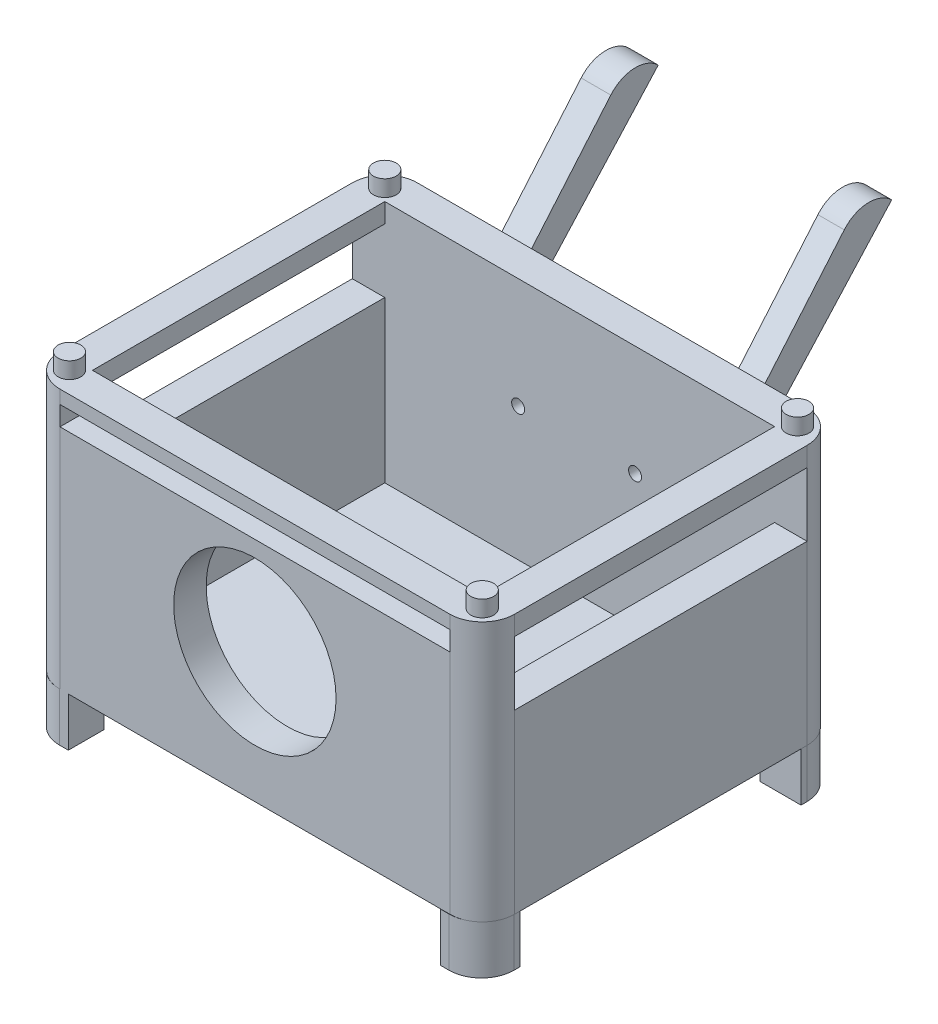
ISO-10303-21;
HEADER;
FILE_DESCRIPTION(('STEP AP214'),'2;1');
FILE_NAME('part.step','',(''),(''),'','','');
FILE_SCHEMA(('AUTOMOTIVE_DESIGN { 1 0 10303 214 1 1 1 1 }'));
ENDSEC;
DATA;
#1=APPLICATION_CONTEXT('core data for automotive mechanical design processes');
#2=APPLICATION_PROTOCOL_DEFINITION('international standard','automotive_design',2000,#1);
#3=PRODUCT_CONTEXT('',#1,'mechanical');
#4=PRODUCT('Part','Part','',(#3));
#5=PRODUCT_RELATED_PRODUCT_CATEGORY('part','',(#4));
#6=PRODUCT_DEFINITION_FORMATION('','',#4);
#7=PRODUCT_DEFINITION_CONTEXT('part definition',#1,'design');
#8=PRODUCT_DEFINITION('design','',#6,#7);
#9=PRODUCT_DEFINITION_SHAPE('','',#8);
#10=(LENGTH_UNIT() NAMED_UNIT(*) SI_UNIT(.MILLI.,.METRE.));
#11=(NAMED_UNIT(*) PLANE_ANGLE_UNIT() SI_UNIT($,.RADIAN.));
#12=(NAMED_UNIT(*) SI_UNIT($,.STERADIAN.) SOLID_ANGLE_UNIT());
#13=UNCERTAINTY_MEASURE_WITH_UNIT(LENGTH_MEASURE(1.E-05),#10,'distance_accuracy_value','');
#14=(GEOMETRIC_REPRESENTATION_CONTEXT(3) GLOBAL_UNCERTAINTY_ASSIGNED_CONTEXT((#13)) GLOBAL_UNIT_ASSIGNED_CONTEXT((#10,
#11,#12)) REPRESENTATION_CONTEXT('',''));
#15=CARTESIAN_POINT('',(0.,0.,0.));
#16=DIRECTION('',(0.,0.,1.));
#17=DIRECTION('',(1.,0.,0.));
#18=AXIS2_PLACEMENT_3D('',#15,#16,#17);
#19=CARTESIAN_POINT('',(-41.1880687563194,80.,75.2717391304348));
#20=DIRECTION('',(0.,0.,1.));
#21=DIRECTION('',(1.,0.,0.));
#22=AXIS2_PLACEMENT_3D('',#19,#20,#21);
#23=PLANE('',#22);
#24=DIRECTION('',(0.,-1.,0.));
#25=VECTOR('',#24,1.);
#26=CARTESIAN_POINT('',(78.8119312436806,80.,75.2717391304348));
#27=LINE('',#26,#25);
#28=CARTESIAN_POINT('',(78.8119312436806,80.,75.2717391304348));
#29=VERTEX_POINT('',#28);
#30=CARTESIAN_POINT('',(78.8119312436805,75.9029079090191,75.2717391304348));
#31=VERTEX_POINT('',#30);
#32=EDGE_CURVE('E891',#29,#31,#27,.T.);
#33=ORIENTED_EDGE('',*,*,#32,.T.);
#34=DIRECTION('',(-1.,0.,0.));
#35=VECTOR('',#34,1.);
#36=CARTESIAN_POINT('',(-41.1880687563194,75.9029079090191,75.2717391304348));
#37=LINE('',#36,#35);
#38=CARTESIAN_POINT('',(-41.1880687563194,75.9029079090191,75.2717391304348));
#39=VERTEX_POINT('',#38);
#40=EDGE_CURVE('E1090',#31,#39,#37,.T.);
#41=ORIENTED_EDGE('',*,*,#40,.T.);
#42=DIRECTION('',(0.,-1.,0.));
#43=VECTOR('',#42,1.);
#44=CARTESIAN_POINT('',(-41.1880687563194,80.,75.2717391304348));
#45=LINE('',#44,#43);
#46=CARTESIAN_POINT('',(-41.1880687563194,80.,75.2717391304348));
#47=VERTEX_POINT('',#46);
#48=EDGE_CURVE('E910',#47,#39,#45,.T.);
#49=ORIENTED_EDGE('',*,*,#48,.F.);
#50=DIRECTION('',(-1.,0.,0.));
#51=VECTOR('',#50,1.);
#52=CARTESIAN_POINT('',(-41.1880687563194,80.,75.2717391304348));
#53=LINE('',#52,#51);
#54=EDGE_CURVE('E903',#29,#47,#53,.T.);
#55=ORIENTED_EDGE('',*,*,#54,.F.);
#56=EDGE_LOOP('',(#33,#41,#49,#55));
#57=FACE_BOUND('',#56,.T.);
#58=ADVANCED_FACE('F43',(#57),#23,.F.);
#59=CARTESIAN_POINT('',(-51.1880687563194,5.,85.2717391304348));
#60=DIRECTION('',(0.,0.,-1.));
#61=DIRECTION('',(-1.,0.,0.));
#62=AXIS2_PLACEMENT_3D('',#59,#60,#61);
#63=PLANE('',#62);
#64=DIRECTION('',(0.,-1.,0.));
#65=VECTOR('',#64,1.);
#66=CARTESIAN_POINT('',(-41.1880687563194,5.,85.2717391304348));
#67=LINE('',#66,#65);
#68=CARTESIAN_POINT('',(-41.1880687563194,80.,85.2717391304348));
#69=VERTEX_POINT('',#68);
#70=CARTESIAN_POINT('',(-41.1880687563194,75.9029079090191,85.2717391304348));
#71=VERTEX_POINT('',#70);
#72=EDGE_CURVE('E421',#69,#71,#67,.T.);
#73=ORIENTED_EDGE('',*,*,#72,.T.);
#74=DIRECTION('',(-1.,0.,0.));
#75=VECTOR('',#74,1.);
#76=CARTESIAN_POINT('',(-41.1880687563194,75.9029079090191,85.2717391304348));
#77=LINE('',#76,#75);
#78=CARTESIAN_POINT('',(78.8119312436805,75.9029079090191,85.2717391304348));
#79=VERTEX_POINT('',#78);
#80=EDGE_CURVE('E67',#79,#71,#77,.T.);
#81=ORIENTED_EDGE('',*,*,#80,.F.);
#82=DIRECTION('',(0.,-1.,0.));
#83=VECTOR('',#82,1.);
#84=CARTESIAN_POINT('',(78.8119312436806,5.,85.2717391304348));
#85=LINE('',#84,#83);
#86=CARTESIAN_POINT('',(78.8119312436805,80.,85.2717391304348));
#87=VERTEX_POINT('',#86);
#88=EDGE_CURVE('E426',#79,#87,#85,.F.);
#89=ORIENTED_EDGE('',*,*,#88,.T.);
#90=DIRECTION('',(1.,0.,0.));
#91=VECTOR('',#90,1.);
#92=CARTESIAN_POINT('',(-51.1880687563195,80.,85.2717391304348));
#93=LINE('',#92,#91);
#94=EDGE_CURVE('E918',#69,#87,#93,.T.);
#95=ORIENTED_EDGE('',*,*,#94,.F.);
#96=EDGE_LOOP('',(#73,#81,#89,#95));
#97=FACE_BOUND('',#96,.T.);
#98=ADVANCED_FACE('F1118',(#97),#63,.F.);
#99=CARTESIAN_POINT('',(-41.1880687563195,80.,-24.7282608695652));
#100=DIRECTION('',(-1.,0.,0.));
#101=DIRECTION('',(0.,0.,1.));
#102=AXIS2_PLACEMENT_3D('',#99,#100,#101);
#103=PLANE('',#102);
#104=ORIENTED_EDGE('',*,*,#48,.T.);
#105=DIRECTION('',(0.,0.,1.));
#106=VECTOR('',#105,1.);
#107=CARTESIAN_POINT('',(-41.1880687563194,75.9029079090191,36.2717391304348));
#108=LINE('',#107,#106);
#109=EDGE_CURVE('E395',#39,#71,#108,.T.);
#110=ORIENTED_EDGE('',*,*,#109,.T.);
#111=DIRECTION('',(0.,-1.,0.));
#112=VECTOR('',#111,1.);
#113=CARTESIAN_POINT('',(-41.1880687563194,75.9029079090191,85.2717391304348));
#114=LINE('',#113,#112);
#115=CARTESIAN_POINT('',(-41.1880687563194,69.9355042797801,85.2717391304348));
#116=VERTEX_POINT('',#115);
#117=EDGE_CURVE('E392',#71,#116,#114,.T.);
#118=ORIENTED_EDGE('',*,*,#117,.T.);
#119=DIRECTION('',(0.,0.,1.));
#120=VECTOR('',#119,1.);
#121=CARTESIAN_POINT('',(-41.1880687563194,69.9355042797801,36.2717391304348));
#122=LINE('',#121,#120);
#123=CARTESIAN_POINT('',(-41.1880687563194,69.9355042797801,75.2717391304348));
#124=VERTEX_POINT('',#123);
#125=EDGE_CURVE('E379',#124,#116,#122,.T.);
#126=ORIENTED_EDGE('',*,*,#125,.F.);
#127=DIRECTION('',(0.,-1.,0.));
#128=VECTOR('',#127,1.);
#129=CARTESIAN_POINT('',(-41.1880687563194,80.,75.2717391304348));
#130=LINE('',#129,#128);
#131=CARTESIAN_POINT('',(-41.1880687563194,74.0458749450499,75.2717391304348));
#132=VERTEX_POINT('',#131);
#133=EDGE_CURVE('E1100',#132,#124,#130,.T.);
#134=ORIENTED_EDGE('',*,*,#133,.F.);
#135=DIRECTION('',(0.,0.,-1.));
#136=VECTOR('',#135,1.);
#137=CARTESIAN_POINT('',(-41.1880687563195,74.0458749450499,-24.7282608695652));
#138=LINE('',#137,#136);
#139=CARTESIAN_POINT('',(-41.1880687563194,74.0458749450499,-14.7282608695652));
#140=VERTEX_POINT('',#139);
#141=EDGE_CURVE('E1039',#132,#140,#138,.T.);
#142=ORIENTED_EDGE('',*,*,#141,.T.);
#143=DIRECTION('',(0.,-1.,0.));
#144=VECTOR('',#143,1.);
#145=CARTESIAN_POINT('',(-41.1880687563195,80.,-14.7282608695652));
#146=LINE('',#145,#144);
#147=CARTESIAN_POINT('',(-41.1880687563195,80.,-14.7282608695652));
#148=VERTEX_POINT('',#147);
#149=EDGE_CURVE('E853',#148,#140,#146,.T.);
#150=ORIENTED_EDGE('',*,*,#149,.F.);
#151=DIRECTION('',(0.,0.,-1.));
#152=VECTOR('',#151,1.);
#153=CARTESIAN_POINT('',(-41.1880687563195,80.,-24.7282608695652));
#154=LINE('',#153,#152);
#155=EDGE_CURVE('E922',#47,#148,#154,.T.);
#156=ORIENTED_EDGE('',*,*,#155,.F.);
#157=EDGE_LOOP('',(#104,#110,#118,#126,#134,#142,#150,#156));
#158=FACE_BOUND('',#157,.T.);
#159=ADVANCED_FACE('F394',(#158),#103,.F.);
#160=CARTESIAN_POINT('',(78.8119312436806,80.,75.2717391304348));
#161=DIRECTION('',(1.,0.,0.));
#162=DIRECTION('',(0.,0.,-1.));
#163=AXIS2_PLACEMENT_3D('',#160,#161,#162);
#164=PLANE('',#163);
#165=DIRECTION('',(0.,0.,1.));
#166=VECTOR('',#165,1.);
#167=CARTESIAN_POINT('',(78.8119312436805,75.9029079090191,36.2717391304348));
#168=LINE('',#167,#166);
#169=EDGE_CURVE('E1105',#31,#79,#168,.T.);
#170=ORIENTED_EDGE('',*,*,#169,.F.);
#171=ORIENTED_EDGE('',*,*,#32,.F.);
#172=DIRECTION('',(0.,0.,1.));
#173=VECTOR('',#172,1.);
#174=CARTESIAN_POINT('',(78.8119312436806,80.,75.2717391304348));
#175=LINE('',#174,#173);
#176=CARTESIAN_POINT('',(78.8119312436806,80.,-14.7282608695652));
#177=VERTEX_POINT('',#176);
#178=EDGE_CURVE('E884',#177,#29,#175,.T.);
#179=ORIENTED_EDGE('',*,*,#178,.F.);
#180=DIRECTION('',(0.,-1.,0.));
#181=VECTOR('',#180,1.);
#182=CARTESIAN_POINT('',(78.8119312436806,80.,-14.7282608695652));
#183=LINE('',#182,#181);
#184=CARTESIAN_POINT('',(78.8119312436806,74.0458749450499,-14.7282608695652));
#185=VERTEX_POINT('',#184);
#186=EDGE_CURVE('E848',#177,#185,#183,.T.);
#187=ORIENTED_EDGE('',*,*,#186,.T.);
#188=DIRECTION('',(0.,0.,1.));
#189=VECTOR('',#188,1.);
#190=CARTESIAN_POINT('',(78.8119312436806,74.0458749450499,75.2717391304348));
#191=LINE('',#190,#189);
#192=CARTESIAN_POINT('',(78.8119312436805,74.0458749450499,75.2717391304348));
#193=VERTEX_POINT('',#192);
#194=EDGE_CURVE('E1041',#185,#193,#191,.T.);
#195=ORIENTED_EDGE('',*,*,#194,.T.);
#196=DIRECTION('',(0.,1.,0.));
#197=VECTOR('',#196,1.);
#198=CARTESIAN_POINT('',(78.8119312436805,80.,75.2717391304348));
#199=LINE('',#198,#197);
#200=CARTESIAN_POINT('',(78.8119312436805,69.9355042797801,75.2717391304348));
#201=VERTEX_POINT('',#200);
#202=EDGE_CURVE('E1096',#201,#193,#199,.T.);
#203=ORIENTED_EDGE('',*,*,#202,.F.);
#204=DIRECTION('',(0.,0.,1.));
#205=VECTOR('',#204,1.);
#206=CARTESIAN_POINT('',(78.8119312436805,69.9355042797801,36.2717391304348));
#207=LINE('',#206,#205);
#208=CARTESIAN_POINT('',(78.8119312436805,69.9355042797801,85.2717391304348));
#209=VERTEX_POINT('',#208);
#210=EDGE_CURVE('E59',#201,#209,#207,.T.);
#211=ORIENTED_EDGE('',*,*,#210,.T.);
#212=DIRECTION('',(0.,1.,0.));
#213=VECTOR('',#212,1.);
#214=CARTESIAN_POINT('',(78.8119312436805,75.9029079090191,85.2717391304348));
#215=LINE('',#214,#213);
#216=EDGE_CURVE('E412',#209,#79,#215,.T.);
#217=ORIENTED_EDGE('',*,*,#216,.T.);
#218=EDGE_LOOP('',(#170,#171,#179,#187,#195,#203,#211,#217));
#219=FACE_BOUND('',#218,.T.);
#220=ADVANCED_FACE('F1115',(#219),#164,.F.);
#221=CARTESIAN_POINT('',(-51.1880687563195,5.,-24.7282608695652));
#222=DIRECTION('',(1.,0.,0.));
#223=DIRECTION('',(0.,0.,-1.));
#224=AXIS2_PLACEMENT_3D('',#221,#222,#223);
#225=PLANE('',#224);
#226=DIRECTION('',(0.,-1.,0.));
#227=VECTOR('',#226,1.);
#228=CARTESIAN_POINT('',(-51.1880687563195,5.,-14.7282608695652));
#229=LINE('',#228,#227);
#230=CARTESIAN_POINT('',(-51.1880687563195,80.,-14.7282608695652));
#231=VERTEX_POINT('',#230);
#232=CARTESIAN_POINT('',(-51.1880687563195,74.0458749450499,-14.7282608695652));
#233=VERTEX_POINT('',#232);
#234=EDGE_CURVE('E445',#231,#233,#229,.T.);
#235=ORIENTED_EDGE('',*,*,#234,.T.);
#236=DIRECTION('',(0.,0.,-1.));
#237=VECTOR('',#236,1.);
#238=CARTESIAN_POINT('',(-51.1880687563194,74.0458749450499,-14.7282608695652));
#239=LINE('',#238,#237);
#240=CARTESIAN_POINT('',(-51.1880687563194,74.0458749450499,75.2717391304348));
#241=VERTEX_POINT('',#240);
#242=EDGE_CURVE('E1063',#241,#233,#239,.T.);
#243=ORIENTED_EDGE('',*,*,#242,.F.);
#244=DIRECTION('',(0.,-1.,0.));
#245=VECTOR('',#244,1.);
#246=CARTESIAN_POINT('',(-51.1880687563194,5.,75.2717391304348));
#247=LINE('',#246,#245);
#248=CARTESIAN_POINT('',(-51.1880687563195,80.,75.2717391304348));
#249=VERTEX_POINT('',#248);
#250=EDGE_CURVE('E439',#241,#249,#247,.F.);
#251=ORIENTED_EDGE('',*,*,#250,.T.);
#252=DIRECTION('',(0.,0.,1.));
#253=VECTOR('',#252,1.);
#254=CARTESIAN_POINT('',(-51.1880687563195,80.,-24.7282608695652));
#255=LINE('',#254,#253);
#256=EDGE_CURVE('E914',#231,#249,#255,.T.);
#257=ORIENTED_EDGE('',*,*,#256,.F.);
#258=EDGE_LOOP('',(#235,#243,#251,#257));
#259=FACE_BOUND('',#258,.T.);
#260=ADVANCED_FACE('F1125',(#259),#225,.F.);
#261=CARTESIAN_POINT('',(88.8119312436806,5.,-24.7282608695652));
#262=DIRECTION('',(-1.,0.,0.));
#263=DIRECTION('',(0.,0.,1.));
#264=AXIS2_PLACEMENT_3D('',#261,#262,#263);
#265=PLANE('',#264);
#266=DIRECTION('',(0.,-1.,0.));
#267=VECTOR('',#266,1.);
#268=CARTESIAN_POINT('',(88.8119312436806,5.,75.2717391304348));
#269=LINE('',#268,#267);
#270=CARTESIAN_POINT('',(88.8119312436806,80.,75.2717391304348));
#271=VERTEX_POINT('',#270);
#272=CARTESIAN_POINT('',(88.8119312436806,74.0458749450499,75.2717391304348));
#273=VERTEX_POINT('',#272);
#274=EDGE_CURVE('E964',#271,#273,#269,.T.);
#275=ORIENTED_EDGE('',*,*,#274,.T.);
#276=DIRECTION('',(0.,0.,-1.));
#277=VECTOR('',#276,1.);
#278=CARTESIAN_POINT('',(88.8119312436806,74.0458749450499,-24.7282608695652));
#279=LINE('',#278,#277);
#280=CARTESIAN_POINT('',(88.8119312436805,74.0458749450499,-14.7282608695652));
#281=VERTEX_POINT('',#280);
#282=EDGE_CURVE('E1030',#273,#281,#279,.T.);
#283=ORIENTED_EDGE('',*,*,#282,.T.);
#284=DIRECTION('',(0.,-1.,0.));
#285=VECTOR('',#284,1.);
#286=CARTESIAN_POINT('',(88.8119312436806,5.,-14.7282608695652));
#287=LINE('',#286,#285);
#288=CARTESIAN_POINT('',(88.8119312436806,80.,-14.7282608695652));
#289=VERTEX_POINT('',#288);
#290=EDGE_CURVE('E462',#281,#289,#287,.F.);
#291=ORIENTED_EDGE('',*,*,#290,.T.);
#292=DIRECTION('',(0.,0.,-1.));
#293=VECTOR('',#292,1.);
#294=CARTESIAN_POINT('',(88.8119312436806,80.,85.2717391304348));
#295=LINE('',#294,#293);
#296=EDGE_CURVE('E899',#271,#289,#295,.T.);
#297=ORIENTED_EDGE('',*,*,#296,.F.);
#298=EDGE_LOOP('',(#275,#283,#291,#297));
#299=FACE_BOUND('',#298,.T.);
#300=ADVANCED_FACE('F1028',(#299),#265,.F.);
#301=CARTESIAN_POINT('',(0.,80.,0.));
#302=DIRECTION('',(0.,1.,0.));
#303=DIRECTION('',(0.,0.,1.));
#304=AXIS2_PLACEMENT_3D('',#301,#302,#303);
#305=PLANE('',#304);
#306=CARTESIAN_POINT('',(-44.7236026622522,80.,78.8072730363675));
#307=DIRECTION('',(0.,1.,0.));
#308=DIRECTION('',(0.,0.,1.));
#309=AXIS2_PLACEMENT_3D('',#306,#307,#308);
#310=CIRCLE('',#309,3.5);
#311=CARTESIAN_POINT('',(-44.7236026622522,80.,82.3072730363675));
#312=VERTEX_POINT('',#311);
#313=EDGE_CURVE('E621',#312,#312,#310,.T.);
#314=ORIENTED_EDGE('',*,*,#313,.F.);
#315=EDGE_LOOP('',(#314));
#316=FACE_BOUND('',#315,.T.);
#317=CARTESIAN_POINT('',(82.3474651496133,80.,78.8072730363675));
#318=DIRECTION('',(0.,1.,0.));
#319=DIRECTION('',(0.,0.,1.));
#320=AXIS2_PLACEMENT_3D('',#317,#318,#319);
#321=CIRCLE('',#320,3.49999999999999);
#322=CARTESIAN_POINT('',(82.3474651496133,80.,82.3072730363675));
#323=VERTEX_POINT('',#322);
#324=EDGE_CURVE('E629',#323,#323,#321,.T.);
#325=ORIENTED_EDGE('',*,*,#324,.F.);
#326=EDGE_LOOP('',(#325));
#327=FACE_BOUND('',#326,.T.);
#328=CARTESIAN_POINT('',(82.3474651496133,80.,-18.2637947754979));
#329=DIRECTION('',(0.,1.,0.));
#330=DIRECTION('',(0.,0.,1.));
#331=AXIS2_PLACEMENT_3D('',#328,#329,#330);
#332=CIRCLE('',#331,3.50000000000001);
#333=CARTESIAN_POINT('',(82.3474651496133,80.,-14.7637947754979));
#334=VERTEX_POINT('',#333);
#335=EDGE_CURVE('E637',#334,#334,#332,.T.);
#336=ORIENTED_EDGE('',*,*,#335,.F.);
#337=EDGE_LOOP('',(#336));
#338=FACE_BOUND('',#337,.T.);
#339=CARTESIAN_POINT('',(-44.7236026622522,80.,-18.2637947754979));
#340=DIRECTION('',(0.,1.,0.));
#341=DIRECTION('',(0.,0.,1.));
#342=AXIS2_PLACEMENT_3D('',#339,#340,#341);
#343=CIRCLE('',#342,3.5);
#344=CARTESIAN_POINT('',(-44.7236026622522,80.,-14.7637947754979));
#345=VERTEX_POINT('',#344);
#346=EDGE_CURVE('E641',#345,#345,#343,.T.);
#347=ORIENTED_EDGE('',*,*,#346,.F.);
#348=EDGE_LOOP('',(#347));
#349=FACE_BOUND('',#348,.T.);
#350=ORIENTED_EDGE('',*,*,#155,.T.);
#351=DIRECTION('',(1.,0.,0.));
#352=VECTOR('',#351,1.);
#353=CARTESIAN_POINT('',(-41.1880687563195,80.,-14.7282608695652));
#354=LINE('',#353,#352);
#355=EDGE_CURVE('E834',#148,#177,#354,.T.);
#356=ORIENTED_EDGE('',*,*,#355,.T.);
#357=ORIENTED_EDGE('',*,*,#178,.T.);
#358=ORIENTED_EDGE('',*,*,#54,.T.);
#359=EDGE_LOOP('',(#350,#356,#357,#358));
#360=FACE_BOUND('',#359,.T.);
#361=DIRECTION('',(-1.,0.,0.));
#362=VECTOR('',#361,1.);
#363=CARTESIAN_POINT('',(-41.1880687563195,80.,-24.7282608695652));
#364=LINE('',#363,#362);
#365=CARTESIAN_POINT('',(78.8119312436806,80.,-24.7282608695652));
#366=VERTEX_POINT('',#365);
#367=CARTESIAN_POINT('',(65.8597491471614,80.,-24.7282608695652));
#368=VERTEX_POINT('',#367);
#369=EDGE_CURVE('E839',#366,#368,#364,.T.);
#370=ORIENTED_EDGE('',*,*,#369,.T.);
#371=DIRECTION('',(1.,0.,0.));
#372=VECTOR('',#371,1.);
#373=CARTESIAN_POINT('',(57.7456341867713,80.,-24.7282608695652));
#374=LINE('',#373,#372);
#375=CARTESIAN_POINT('',(57.7456341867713,80.,-24.7282608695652));
#376=VERTEX_POINT('',#375);
#377=EDGE_CURVE('E593',#376,#368,#374,.T.);
#378=ORIENTED_EDGE('',*,*,#377,.F.);
#379=CARTESIAN_POINT('',(-6.00812621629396,80.,-24.7282608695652));
#380=VERTEX_POINT('',#379);
#381=EDGE_CURVE('E844',#376,#380,#364,.T.);
#382=ORIENTED_EDGE('',*,*,#381,.T.);
#383=DIRECTION('',(1.,0.,0.));
#384=VECTOR('',#383,1.);
#385=CARTESIAN_POINT('',(-15.1365055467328,80.,-24.7282608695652));
#386=LINE('',#385,#384);
#387=CARTESIAN_POINT('',(-15.1365055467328,80.,-24.7282608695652));
#388=VERTEX_POINT('',#387);
#389=EDGE_CURVE('E596',#388,#380,#386,.T.);
#390=ORIENTED_EDGE('',*,*,#389,.F.);
#391=CARTESIAN_POINT('',(-41.1880687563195,80.,-24.7282608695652));
#392=VERTEX_POINT('',#391);
#393=EDGE_CURVE('E838',#388,#392,#364,.T.);
#394=ORIENTED_EDGE('',*,*,#393,.T.);
#395=CARTESIAN_POINT('',(-41.1880687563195,80.,-14.7282608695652));
#396=DIRECTION('',(0.,1.,0.));
#397=DIRECTION('',(0.,0.,1.));
#398=AXIS2_PLACEMENT_3D('',#395,#396,#397);
#399=CIRCLE('',#398,10.);
#400=EDGE_CURVE('E459',#392,#231,#399,.T.);
#401=ORIENTED_EDGE('',*,*,#400,.T.);
#402=ORIENTED_EDGE('',*,*,#256,.T.);
#403=CARTESIAN_POINT('',(-41.1880687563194,80.,75.2717391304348));
#404=DIRECTION('',(0.,1.,0.));
#405=DIRECTION('',(0.,0.,1.));
#406=AXIS2_PLACEMENT_3D('',#403,#404,#405);
#407=CIRCLE('',#406,10.);
#408=EDGE_CURVE('E433',#249,#69,#407,.T.);
#409=ORIENTED_EDGE('',*,*,#408,.T.);
#410=ORIENTED_EDGE('',*,*,#94,.T.);
#411=CARTESIAN_POINT('',(78.8119312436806,80.,75.2717391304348));
#412=DIRECTION('',(0.,1.,0.));
#413=DIRECTION('',(0.,0.,1.));
#414=AXIS2_PLACEMENT_3D('',#411,#412,#413);
#415=CIRCLE('',#414,10.);
#416=EDGE_CURVE('E436',#87,#271,#415,.T.);
#417=ORIENTED_EDGE('',*,*,#416,.T.);
#418=ORIENTED_EDGE('',*,*,#296,.T.);
#419=CARTESIAN_POINT('',(78.8119312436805,80.,-14.7282608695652));
#420=DIRECTION('',(0.,1.,0.));
#421=DIRECTION('',(0.,0.,1.));
#422=AXIS2_PLACEMENT_3D('',#419,#420,#421);
#423=CIRCLE('',#422,10.);
#424=EDGE_CURVE('E456',#289,#366,#423,.T.);
#425=ORIENTED_EDGE('',*,*,#424,.T.);
#426=EDGE_LOOP('',(#370,#378,#382,#390,#394,#401,#402,#409,#410,#417,#418,#425));
#427=FACE_BOUND('',#426,.T.);
#428=ADVANCED_FACE('F1032',(#316,#327,#338,#349,#360,#427),#305,.T.);
#429=CARTESIAN_POINT('',(-51.1880687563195,5.,-24.7282608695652));
#430=DIRECTION('',(0.,0.,1.));
#431=DIRECTION('',(1.,0.,0.));
#432=AXIS2_PLACEMENT_3D('',#429,#430,#431);
#433=PLANE('',#432);
#434=DIRECTION('',(0.,1.,0.));
#435=VECTOR('',#434,1.);
#436=CARTESIAN_POINT('',(-15.1365055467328,66.4135769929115,-24.7282608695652));
#437=LINE('',#436,#435);
#438=CARTESIAN_POINT('',(-15.1365055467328,66.4135769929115,-24.7282608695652));
#439=VERTEX_POINT('',#438);
#440=EDGE_CURVE('E600',#439,#388,#437,.T.);
#441=ORIENTED_EDGE('',*,*,#440,.F.);
#442=DIRECTION('',(-1.,0.,0.));
#443=VECTOR('',#442,1.);
#444=CARTESIAN_POINT('',(-6.00812621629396,66.4135769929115,-24.7282608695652));
#445=LINE('',#444,#443);
#446=CARTESIAN_POINT('',(-6.00812621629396,66.4135769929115,-24.7282608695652));
#447=VERTEX_POINT('',#446);
#448=EDGE_CURVE('E604',#447,#439,#445,.T.);
#449=ORIENTED_EDGE('',*,*,#448,.F.);
#450=DIRECTION('',(0.,-1.,0.));
#451=VECTOR('',#450,1.);
#452=CARTESIAN_POINT('',(-6.00812621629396,66.4135769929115,-24.7282608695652));
#453=LINE('',#452,#451);
#454=EDGE_CURVE('E607',#380,#447,#453,.T.);
#455=ORIENTED_EDGE('',*,*,#454,.F.);
#456=ORIENTED_EDGE('',*,*,#381,.F.);
#457=DIRECTION('',(0.,1.,0.));
#458=VECTOR('',#457,1.);
#459=CARTESIAN_POINT('',(57.7456341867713,80.,-24.7282608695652));
#460=LINE('',#459,#458);
#461=CARTESIAN_POINT('',(57.7456341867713,66.4135769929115,-24.7282608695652));
#462=VERTEX_POINT('',#461);
#463=EDGE_CURVE('E617',#462,#376,#460,.T.);
#464=ORIENTED_EDGE('',*,*,#463,.F.);
#465=DIRECTION('',(-1.,0.,0.));
#466=VECTOR('',#465,1.);
#467=CARTESIAN_POINT('',(65.8597491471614,66.4135769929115,-24.7282608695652));
#468=LINE('',#467,#466);
#469=CARTESIAN_POINT('',(65.8597491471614,66.4135769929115,-24.7282608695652));
#470=VERTEX_POINT('',#469);
#471=EDGE_CURVE('E560',#470,#462,#468,.T.);
#472=ORIENTED_EDGE('',*,*,#471,.F.);
#473=DIRECTION('',(0.,-1.,0.));
#474=VECTOR('',#473,1.);
#475=CARTESIAN_POINT('',(65.8597491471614,80.,-24.7282608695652));
#476=LINE('',#475,#474);
#477=EDGE_CURVE('E611',#368,#470,#476,.T.);
#478=ORIENTED_EDGE('',*,*,#477,.F.);
#479=ORIENTED_EDGE('',*,*,#369,.F.);
#480=DIRECTION('',(0.,-1.,0.));
#481=VECTOR('',#480,1.);
#482=CARTESIAN_POINT('',(78.8119312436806,80.,-24.7282608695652));
#483=LINE('',#482,#481);
#484=CARTESIAN_POINT('',(78.8119312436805,0.,-24.7282608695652));
#485=VERTEX_POINT('',#484);
#486=EDGE_CURVE('E895',#366,#485,#483,.T.);
#487=ORIENTED_EDGE('',*,*,#486,.T.);
#488=DIRECTION('',(-1.,0.,0.));
#489=VECTOR('',#488,1.);
#490=CARTESIAN_POINT('',(-51.1880687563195,0.,-24.7282608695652));
#491=LINE('',#490,#489);
#492=CARTESIAN_POINT('',(-41.1880687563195,0.,-24.7282608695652));
#493=VERTEX_POINT('',#492);
#494=EDGE_CURVE('E945',#485,#493,#491,.T.);
#495=ORIENTED_EDGE('',*,*,#494,.T.);
#496=DIRECTION('',(0.,-1.,0.));
#497=VECTOR('',#496,1.);
#498=CARTESIAN_POINT('',(-41.1880687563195,80.,-24.7282608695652));
#499=LINE('',#498,#497);
#500=EDGE_CURVE('E926',#392,#493,#499,.T.);
#501=ORIENTED_EDGE('',*,*,#500,.F.);
#502=ORIENTED_EDGE('',*,*,#393,.F.);
#503=EDGE_LOOP('',(#441,#449,#455,#456,#464,#472,#478,#479,#487,#495,#501,#502));
#504=FACE_BOUND('',#503,.T.);
#505=CARTESIAN_POINT('',(-0.133497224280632,45.9752266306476,-24.7282608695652));
#506=DIRECTION('',(0.,0.,1.));
#507=DIRECTION('',(1.,0.,0.));
#508=AXIS2_PLACEMENT_3D('',#505,#506,#507);
#509=CIRCLE('',#508,2.);
#510=CARTESIAN_POINT('',(1.86650277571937,45.9752266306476,-24.7282608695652));
#511=VERTEX_POINT('',#510);
#512=EDGE_CURVE('E664',#511,#511,#509,.T.);
#513=ORIENTED_EDGE('',*,*,#512,.T.);
#514=EDGE_LOOP('',(#513));
#515=FACE_BOUND('',#514,.T.);
#516=CARTESIAN_POINT('',(35.8665027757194,45.9752266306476,-24.7282608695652));
#517=DIRECTION('',(0.,0.,1.));
#518=DIRECTION('',(1.,0.,0.));
#519=AXIS2_PLACEMENT_3D('',#516,#517,#518);
#520=CIRCLE('',#519,2.);
#521=CARTESIAN_POINT('',(37.8665027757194,45.9752266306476,-24.7282608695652));
#522=VERTEX_POINT('',#521);
#523=EDGE_CURVE('E657',#522,#522,#520,.T.);
#524=ORIENTED_EDGE('',*,*,#523,.T.);
#525=EDGE_LOOP('',(#524));
#526=FACE_BOUND('',#525,.T.);
#527=ADVANCED_FACE('F1393',(#504,#515,#526),#433,.F.);
#528=CARTESIAN_POINT('',(0.,0.,0.));
#529=DIRECTION('',(0.,1.,0.));
#530=DIRECTION('',(0.,0.,1.));
#531=AXIS2_PLACEMENT_3D('',#528,#529,#530);
#532=PLANE('',#531);
#533=CARTESIAN_POINT('',(78.8119312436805,0.,-14.7282608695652));
#534=DIRECTION('',(0.,1.,0.));
#535=DIRECTION('',(0.,0.,1.));
#536=AXIS2_PLACEMENT_3D('',#533,#534,#535);
#537=CIRCLE('',#536,10.);
#538=CARTESIAN_POINT('',(88.8119312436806,0.,-14.7282608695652));
#539=VERTEX_POINT('',#538);
#540=EDGE_CURVE('E449',#485,#539,#537,.F.);
#541=ORIENTED_EDGE('',*,*,#540,.T.);
#542=DIRECTION('',(0.,0.,-1.));
#543=VECTOR('',#542,1.);
#544=CARTESIAN_POINT('',(88.8119312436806,0.,-24.7282608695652));
#545=LINE('',#544,#543);
#546=CARTESIAN_POINT('',(88.8119312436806,0.,75.2717391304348));
#547=VERTEX_POINT('',#546);
#548=EDGE_CURVE('E941',#547,#539,#545,.T.);
#549=ORIENTED_EDGE('',*,*,#548,.F.);
#550=CARTESIAN_POINT('',(78.8119312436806,0.,75.2717391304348));
#551=DIRECTION('',(0.,1.,0.));
#552=DIRECTION('',(0.,0.,1.));
#553=AXIS2_PLACEMENT_3D('',#550,#551,#552);
#554=CIRCLE('',#553,10.);
#555=CARTESIAN_POINT('',(82.7036486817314,0.,84.4833912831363));
#556=VERTEX_POINT('',#555);
#557=EDGE_CURVE('E422',#547,#556,#554,.F.);
#558=ORIENTED_EDGE('',*,*,#557,.T.);
#559=CARTESIAN_POINT('',(78.6556135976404,0.,75.3393543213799));
#560=DIRECTION('',(0.,1.,0.));
#561=DIRECTION('',(0.,0.,1.));
#562=AXIS2_PLACEMENT_3D('',#559,#560,#561);
#563=CIRCLE('',#562,10.);
#564=CARTESIAN_POINT('',(88.6556135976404,0.,75.3393543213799));
#565=VERTEX_POINT('',#564);
#566=EDGE_CURVE('E522',#556,#565,#563,.T.);
#567=ORIENTED_EDGE('',*,*,#566,.T.);
#568=DIRECTION('',(0.,0.,1.));
#569=VECTOR('',#568,1.);
#570=CARTESIAN_POINT('',(88.6556135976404,0.,85.3393543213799));
#571=LINE('',#570,#569);
#572=CARTESIAN_POINT('',(88.6556135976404,0.,73.5601852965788));
#573=VERTEX_POINT('',#572);
#574=EDGE_CURVE('E694',#573,#565,#571,.T.);
#575=ORIENTED_EDGE('',*,*,#574,.F.);
#576=DIRECTION('',(1.,0.,0.));
#577=VECTOR('',#576,1.);
#578=CARTESIAN_POINT('',(88.6556135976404,0.,73.5601852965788));
#579=LINE('',#578,#577);
#580=CARTESIAN_POINT('',(76.097218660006,0.,73.5601852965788));
#581=VERTEX_POINT('',#580);
#582=EDGE_CURVE('E681',#581,#573,#579,.T.);
#583=ORIENTED_EDGE('',*,*,#582,.F.);
#584=DIRECTION('',(0.,0.,-1.));
#585=VECTOR('',#584,1.);
#586=CARTESIAN_POINT('',(76.097218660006,0.,85.3393543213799));
#587=LINE('',#586,#585);
#588=CARTESIAN_POINT('',(76.097218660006,0.,85.2717391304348));
#589=VERTEX_POINT('',#588);
#590=EDGE_CURVE('E685',#589,#581,#587,.T.);
#591=ORIENTED_EDGE('',*,*,#590,.F.);
#592=DIRECTION('',(1.,0.,0.));
#593=VECTOR('',#592,1.);
#594=CARTESIAN_POINT('',(-51.1880687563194,0.,85.2717391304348));
#595=LINE('',#594,#593);
#596=CARTESIAN_POINT('',(-38.6115177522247,0.,85.2717391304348));
#597=VERTEX_POINT('',#596);
#598=EDGE_CURVE('E937',#597,#589,#595,.T.);
#599=ORIENTED_EDGE('',*,*,#598,.F.);
#600=DIRECTION('',(0.,0.,1.));
#601=VECTOR('',#600,1.);
#602=CARTESIAN_POINT('',(-38.6115177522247,0.,74.2410618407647));
#603=LINE('',#602,#601);
#604=CARTESIAN_POINT('',(-38.6115177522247,0.,74.2410618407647));
#605=VERTEX_POINT('',#604);
#606=EDGE_CURVE('E812',#605,#597,#603,.T.);
#607=ORIENTED_EDGE('',*,*,#606,.F.);
#608=DIRECTION('',(1.,0.,0.));
#609=VECTOR('',#608,1.);
#610=CARTESIAN_POINT('',(-51.2741244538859,0.,74.2410618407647));
#611=LINE('',#610,#609);
#612=CARTESIAN_POINT('',(-51.1880687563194,0.,74.2410618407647));
#613=VERTEX_POINT('',#612);
#614=EDGE_CURVE('E467',#613,#605,#611,.T.);
#615=ORIENTED_EDGE('',*,*,#614,.F.);
#616=DIRECTION('',(0.,0.,1.));
#617=VECTOR('',#616,1.);
#618=CARTESIAN_POINT('',(-51.1880687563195,0.,-24.7282608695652));
#619=LINE('',#618,#617);
#620=CARTESIAN_POINT('',(-51.1880687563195,0.,-14.7282608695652));
#621=VERTEX_POINT('',#620);
#622=EDGE_CURVE('E933',#621,#613,#619,.T.);
#623=ORIENTED_EDGE('',*,*,#622,.F.);
#624=CARTESIAN_POINT('',(-41.1880687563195,0.,-14.7282608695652));
#625=DIRECTION('',(0.,1.,0.));
#626=DIRECTION('',(0.,0.,1.));
#627=AXIS2_PLACEMENT_3D('',#624,#625,#626);
#628=CIRCLE('',#627,10.);
#629=EDGE_CURVE('E452',#621,#493,#628,.F.);
#630=ORIENTED_EDGE('',*,*,#629,.T.);
#631=ORIENTED_EDGE('',*,*,#494,.F.);
#632=EDGE_LOOP('',(#541,#549,#558,#567,#575,#583,#591,#599,#607,#615,#623,#630,#631));
#633=FACE_BOUND('',#632,.T.);
#634=DIRECTION('',(0.,0.,1.));
#635=VECTOR('',#634,1.);
#636=CARTESIAN_POINT('',(88.8028532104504,0.,-12.8694674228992));
#637=LINE('',#636,#635);
#638=CARTESIAN_POINT('',(88.8028532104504,0.,-14.6486364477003));
#639=VERTEX_POINT('',#638);
#640=CARTESIAN_POINT('',(88.8028532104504,0.,-12.8694674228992));
#641=VERTEX_POINT('',#640);
#642=EDGE_CURVE('E738',#639,#641,#637,.T.);
#643=ORIENTED_EDGE('',*,*,#642,.F.);
#644=CARTESIAN_POINT('',(78.8028532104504,0.,-14.6486364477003));
#645=DIRECTION('',(0.,1.,0.));
#646=DIRECTION('',(0.,0.,1.));
#647=AXIS2_PLACEMENT_3D('',#644,#645,#646);
#648=CIRCLE('',#647,10.);
#649=CARTESIAN_POINT('',(78.8028532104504,0.,-24.6486364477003));
#650=VERTEX_POINT('',#649);
#651=EDGE_CURVE('E519',#639,#650,#648,.T.);
#652=ORIENTED_EDGE('',*,*,#651,.T.);
#653=DIRECTION('',(1.,0.,0.));
#654=VECTOR('',#653,1.);
#655=CARTESIAN_POINT('',(88.8028532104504,0.,-24.6486364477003));
#656=LINE('',#655,#654);
#657=CARTESIAN_POINT('',(76.244458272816,0.,-24.6486364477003));
#658=VERTEX_POINT('',#657);
#659=EDGE_CURVE('E725',#658,#650,#656,.T.);
#660=ORIENTED_EDGE('',*,*,#659,.F.);
#661=DIRECTION('',(0.,0.,-1.));
#662=VECTOR('',#661,1.);
#663=CARTESIAN_POINT('',(76.244458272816,0.,-12.8694674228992));
#664=LINE('',#663,#662);
#665=CARTESIAN_POINT('',(76.244458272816,0.,-12.8694674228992));
#666=VERTEX_POINT('',#665);
#667=EDGE_CURVE('E729',#666,#658,#664,.T.);
#668=ORIENTED_EDGE('',*,*,#667,.F.);
#669=DIRECTION('',(-1.,0.,0.));
#670=VECTOR('',#669,1.);
#671=CARTESIAN_POINT('',(88.8028532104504,0.,-12.8694674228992));
#672=LINE('',#671,#670);
#673=EDGE_CURVE('E734',#641,#666,#672,.T.);
#674=ORIENTED_EDGE('',*,*,#673,.F.);
#675=EDGE_LOOP('',(#643,#652,#660,#668,#674));
#676=FACE_BOUND('',#675,.T.);
#677=CARTESIAN_POINT('',(38.6400474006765,0.,15.2778290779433));
#678=DIRECTION('',(0.,1.,0.));
#679=DIRECTION('',(0.,0.,1.));
#680=AXIS2_PLACEMENT_3D('',#677,#678,#679);
#681=CIRCLE('',#680,1.5);
#682=CARTESIAN_POINT('',(38.6400474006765,0.,16.7778290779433));
#683=VERTEX_POINT('',#682);
#684=EDGE_CURVE('E883',#683,#683,#681,.T.);
#685=ORIENTED_EDGE('',*,*,#684,.T.);
#686=EDGE_LOOP('',(#685));
#687=FACE_BOUND('',#686,.T.);
#688=CARTESIAN_POINT('',(-1.35995259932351,0.,67.3569441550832));
#689=DIRECTION('',(0.,1.,0.));
#690=DIRECTION('',(0.,0.,1.));
#691=AXIS2_PLACEMENT_3D('',#688,#689,#690);
#692=CIRCLE('',#691,1.43643888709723);
#693=CARTESIAN_POINT('',(-1.35995259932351,0.,68.7933830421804));
#694=VERTEX_POINT('',#693);
#695=EDGE_CURVE('E957',#694,#694,#692,.T.);
#696=ORIENTED_EDGE('',*,*,#695,.T.);
#697=EDGE_LOOP('',(#696));
#698=FACE_BOUND('',#697,.T.);
#699=CARTESIAN_POINT('',(38.6400474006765,0.,67.3569441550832));
#700=DIRECTION('',(0.,1.,0.));
#701=DIRECTION('',(0.,0.,1.));
#702=AXIS2_PLACEMENT_3D('',#699,#700,#701);
#703=CIRCLE('',#702,1.5);
#704=CARTESIAN_POINT('',(38.6400474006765,0.,68.8569441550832));
#705=VERTEX_POINT('',#704);
#706=EDGE_CURVE('E953',#705,#705,#703,.T.);
#707=ORIENTED_EDGE('',*,*,#706,.T.);
#708=EDGE_LOOP('',(#707));
#709=FACE_BOUND('',#708,.T.);
#710=CARTESIAN_POINT('',(-1.35995259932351,0.,15.2778290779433));
#711=DIRECTION('',(0.,1.,0.));
#712=DIRECTION('',(0.,0.,1.));
#713=AXIS2_PLACEMENT_3D('',#710,#711,#712);
#714=CIRCLE('',#713,1.5);
#715=CARTESIAN_POINT('',(-1.35995259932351,0.,16.7778290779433));
#716=VERTEX_POINT('',#715);
#717=EDGE_CURVE('E873',#716,#716,#714,.T.);
#718=ORIENTED_EDGE('',*,*,#717,.T.);
#719=EDGE_LOOP('',(#718));
#720=FACE_BOUND('',#719,.T.);
#721=DIRECTION('',(1.,0.,0.));
#722=VECTOR('',#721,1.);
#723=CARTESIAN_POINT('',(-38.6115177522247,0.,-24.5013968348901));
#724=LINE('',#723,#722);
#725=CARTESIAN_POINT('',(-41.1699126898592,0.,-24.5013968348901));
#726=VERTEX_POINT('',#725);
#727=CARTESIAN_POINT('',(-38.6115177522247,0.,-24.5013968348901));
#728=VERTEX_POINT('',#727);
#729=EDGE_CURVE('E758',#726,#728,#724,.T.);
#730=ORIENTED_EDGE('',*,*,#729,.F.);
#731=CARTESIAN_POINT('',(-41.1699126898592,0.,-14.5013968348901));
#732=DIRECTION('',(0.,1.,0.));
#733=DIRECTION('',(0.,0.,1.));
#734=AXIS2_PLACEMENT_3D('',#731,#732,#733);
#735=CIRCLE('',#734,10.);
#736=CARTESIAN_POINT('',(-51.1699126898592,0.,-14.5013968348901));
#737=VERTEX_POINT('',#736);
#738=EDGE_CURVE('E516',#726,#737,#735,.T.);
#739=ORIENTED_EDGE('',*,*,#738,.T.);
#740=DIRECTION('',(0.,0.,-1.));
#741=VECTOR('',#740,1.);
#742=CARTESIAN_POINT('',(-51.1699126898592,0.,-12.722227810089));
#743=LINE('',#742,#741);
#744=CARTESIAN_POINT('',(-51.1699126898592,0.,-12.722227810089));
#745=VERTEX_POINT('',#744);
#746=EDGE_CURVE('E776',#745,#737,#743,.T.);
#747=ORIENTED_EDGE('',*,*,#746,.F.);
#748=DIRECTION('',(-1.,0.,0.));
#749=VECTOR('',#748,1.);
#750=CARTESIAN_POINT('',(-38.6115177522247,0.,-12.722227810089));
#751=LINE('',#750,#749);
#752=CARTESIAN_POINT('',(-38.6115177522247,0.,-12.722227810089));
#753=VERTEX_POINT('',#752);
#754=EDGE_CURVE('E772',#753,#745,#751,.T.);
#755=ORIENTED_EDGE('',*,*,#754,.F.);
#756=DIRECTION('',(0.,0.,1.));
#757=VECTOR('',#756,1.);
#758=CARTESIAN_POINT('',(-38.6115177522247,0.,-12.722227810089));
#759=LINE('',#758,#757);
#760=EDGE_CURVE('E741',#728,#753,#759,.T.);
#761=ORIENTED_EDGE('',*,*,#760,.F.);
#762=EDGE_LOOP('',(#730,#739,#747,#755,#761));
#763=FACE_BOUND('',#762,.T.);
#764=ADVANCED_FACE('F986',(#633,#676,#687,#698,#709,#720,#763),#532,.F.);
#765=CARTESIAN_POINT('',(0.,5.,0.));
#766=DIRECTION('',(0.,1.,0.));
#767=DIRECTION('',(0.,0.,1.));
#768=AXIS2_PLACEMENT_3D('',#765,#766,#767);
#769=PLANE('',#768);
#770=CARTESIAN_POINT('',(38.6400474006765,5.,15.2778290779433));
#771=DIRECTION('',(0.,1.,0.));
#772=DIRECTION('',(0.,0.,1.));
#773=AXIS2_PLACEMENT_3D('',#770,#771,#772);
#774=CIRCLE('',#773,1.5);
#775=CARTESIAN_POINT('',(38.6400474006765,5.,16.7778290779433));
#776=VERTEX_POINT('',#775);
#777=EDGE_CURVE('E862',#776,#776,#774,.T.);
#778=ORIENTED_EDGE('',*,*,#777,.F.);
#779=EDGE_LOOP('',(#778));
#780=FACE_BOUND('',#779,.T.);
#781=CARTESIAN_POINT('',(-1.35995259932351,5.,67.3569441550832));
#782=DIRECTION('',(0.,1.,0.));
#783=DIRECTION('',(0.,0.,1.));
#784=AXIS2_PLACEMENT_3D('',#781,#782,#783);
#785=CIRCLE('',#784,1.43643888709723);
#786=CARTESIAN_POINT('',(-1.35995259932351,5.,68.7933830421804));
#787=VERTEX_POINT('',#786);
#788=EDGE_CURVE('E861',#787,#787,#785,.T.);
#789=ORIENTED_EDGE('',*,*,#788,.F.);
#790=EDGE_LOOP('',(#789));
#791=FACE_BOUND('',#790,.T.);
#792=CARTESIAN_POINT('',(38.6400474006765,5.,67.3569441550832));
#793=DIRECTION('',(0.,1.,0.));
#794=DIRECTION('',(0.,0.,1.));
#795=AXIS2_PLACEMENT_3D('',#792,#793,#794);
#796=CIRCLE('',#795,1.5);
#797=CARTESIAN_POINT('',(38.6400474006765,5.,68.8569441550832));
#798=VERTEX_POINT('',#797);
#799=EDGE_CURVE('E857',#798,#798,#796,.T.);
#800=ORIENTED_EDGE('',*,*,#799,.F.);
#801=EDGE_LOOP('',(#800));
#802=FACE_BOUND('',#801,.T.);
#803=CARTESIAN_POINT('',(-1.35995259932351,5.,15.2778290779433));
#804=DIRECTION('',(0.,1.,0.));
#805=DIRECTION('',(0.,0.,1.));
#806=AXIS2_PLACEMENT_3D('',#803,#804,#805);
#807=CIRCLE('',#806,1.5);
#808=CARTESIAN_POINT('',(-1.35995259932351,5.,16.7778290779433));
#809=VERTEX_POINT('',#808);
#810=EDGE_CURVE('E866',#809,#809,#807,.T.);
#811=ORIENTED_EDGE('',*,*,#810,.F.);
#812=EDGE_LOOP('',(#811));
#813=FACE_BOUND('',#812,.T.);
#814=DIRECTION('',(0.,0.,1.));
#815=VECTOR('',#814,1.);
#816=CARTESIAN_POINT('',(78.8119312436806,5.,75.2717391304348));
#817=LINE('',#816,#815);
#818=CARTESIAN_POINT('',(78.8119312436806,5.,-14.7282608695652));
#819=VERTEX_POINT('',#818);
#820=CARTESIAN_POINT('',(78.8119312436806,5.,75.2717391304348));
#821=VERTEX_POINT('',#820);
#822=EDGE_CURVE('E878',#819,#821,#817,.T.);
#823=ORIENTED_EDGE('',*,*,#822,.F.);
#824=DIRECTION('',(1.,0.,0.));
#825=VECTOR('',#824,1.);
#826=CARTESIAN_POINT('',(-41.1880687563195,5.,-14.7282608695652));
#827=LINE('',#826,#825);
#828=CARTESIAN_POINT('',(-41.1880687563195,5.,-14.7282608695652));
#829=VERTEX_POINT('',#828);
#830=EDGE_CURVE('E826',#829,#819,#827,.T.);
#831=ORIENTED_EDGE('',*,*,#830,.F.);
#832=DIRECTION('',(0.,0.,-1.));
#833=VECTOR('',#832,1.);
#834=CARTESIAN_POINT('',(-41.1880687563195,5.,-24.7282608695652));
#835=LINE('',#834,#833);
#836=CARTESIAN_POINT('',(-41.1880687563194,5.,75.2717391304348));
#837=VERTEX_POINT('',#836);
#838=EDGE_CURVE('E913',#837,#829,#835,.T.);
#839=ORIENTED_EDGE('',*,*,#838,.F.);
#840=DIRECTION('',(-1.,0.,0.));
#841=VECTOR('',#840,1.);
#842=CARTESIAN_POINT('',(-41.1880687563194,5.,75.2717391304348));
#843=LINE('',#842,#841);
#844=EDGE_CURVE('E898',#821,#837,#843,.T.);
#845=ORIENTED_EDGE('',*,*,#844,.F.);
#846=EDGE_LOOP('',(#823,#831,#839,#845));
#847=FACE_BOUND('',#846,.T.);
#848=ADVANCED_FACE('F1167',(#780,#791,#802,#813,#847),#769,.T.);
#849=CARTESIAN_POINT('',(-41.1880687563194,54.4216796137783,-14.7282608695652));
#850=VERTEX_POINT('',#849);
#851=EDGE_CURVE('E852',#850,#829,#146,.T.);
#852=ORIENTED_EDGE('',*,*,#851,.F.);
#853=DIRECTION('',(0.,0.,1.));
#854=VECTOR('',#853,1.);
#855=CARTESIAN_POINT('',(-41.1880687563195,54.4216796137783,-24.7282608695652));
#856=LINE('',#855,#854);
#857=CARTESIAN_POINT('',(-41.1880687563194,54.4216796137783,75.2717391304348));
#858=VERTEX_POINT('',#857);
#859=EDGE_CURVE('E1048',#850,#858,#856,.T.);
#860=ORIENTED_EDGE('',*,*,#859,.T.);
#861=EDGE_CURVE('E906',#858,#837,#45,.T.);
#862=ORIENTED_EDGE('',*,*,#861,.T.);
#863=ORIENTED_EDGE('',*,*,#838,.T.);
#864=EDGE_LOOP('',(#852,#860,#862,#863));
#865=FACE_BOUND('',#864,.T.);
#866=ADVANCED_FACE('F1170',(#865),#103,.F.);
#867=CARTESIAN_POINT('',(78.8119312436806,54.4216796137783,75.2717391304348));
#868=VERTEX_POINT('',#867);
#869=EDGE_CURVE('E887',#868,#821,#27,.T.);
#870=ORIENTED_EDGE('',*,*,#869,.F.);
#871=DIRECTION('',(0.,0.,-1.));
#872=VECTOR('',#871,1.);
#873=CARTESIAN_POINT('',(78.8119312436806,54.4216796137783,75.2717391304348));
#874=LINE('',#873,#872);
#875=CARTESIAN_POINT('',(78.8119312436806,54.4216796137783,-14.7282608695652));
#876=VERTEX_POINT('',#875);
#877=EDGE_CURVE('E1052',#868,#876,#874,.T.);
#878=ORIENTED_EDGE('',*,*,#877,.T.);
#879=EDGE_CURVE('E843',#876,#819,#183,.T.);
#880=ORIENTED_EDGE('',*,*,#879,.T.);
#881=ORIENTED_EDGE('',*,*,#822,.T.);
#882=EDGE_LOOP('',(#870,#878,#880,#881));
#883=FACE_BOUND('',#882,.T.);
#884=ADVANCED_FACE('F1162',(#883),#164,.F.);
#885=DIRECTION('',(-1.,0.,0.));
#886=VECTOR('',#885,1.);
#887=CARTESIAN_POINT('',(146.811931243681,74.0458749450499,75.2717391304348));
#888=LINE('',#887,#886);
#889=EDGE_CURVE('E1068',#132,#241,#888,.T.);
#890=ORIENTED_EDGE('',*,*,#889,.F.);
#891=ORIENTED_EDGE('',*,*,#133,.T.);
#892=DIRECTION('',(1.,0.,0.));
#893=VECTOR('',#892,1.);
#894=CARTESIAN_POINT('',(-41.1880687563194,69.9355042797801,75.2717391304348));
#895=LINE('',#894,#893);
#896=EDGE_CURVE('E386',#124,#201,#895,.T.);
#897=ORIENTED_EDGE('',*,*,#896,.T.);
#898=ORIENTED_EDGE('',*,*,#202,.T.);
#899=EDGE_CURVE('E1071',#273,#193,#888,.T.);
#900=ORIENTED_EDGE('',*,*,#899,.F.);
#901=DIRECTION('',(0.,-1.,0.));
#902=VECTOR('',#901,1.);
#903=CARTESIAN_POINT('',(88.8119312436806,5.,75.2717391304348));
#904=LINE('',#903,#902);
#905=CARTESIAN_POINT('',(88.8119312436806,54.4216796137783,75.2717391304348));
#906=VERTEX_POINT('',#905);
#907=EDGE_CURVE('E574',#273,#906,#904,.T.);
#908=ORIENTED_EDGE('',*,*,#907,.T.);
#909=DIRECTION('',(-1.,0.,0.));
#910=VECTOR('',#909,1.);
#911=CARTESIAN_POINT('',(146.811931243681,54.4216796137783,75.2717391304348));
#912=LINE('',#911,#910);
#913=EDGE_CURVE('E1067',#906,#868,#912,.T.);
#914=ORIENTED_EDGE('',*,*,#913,.T.);
#915=ORIENTED_EDGE('',*,*,#869,.T.);
#916=ORIENTED_EDGE('',*,*,#844,.T.);
#917=ORIENTED_EDGE('',*,*,#861,.F.);
#918=CARTESIAN_POINT('',(-51.1880687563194,54.4216796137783,75.2717391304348));
#919=VERTEX_POINT('',#918);
#920=EDGE_CURVE('E1064',#858,#919,#912,.T.);
#921=ORIENTED_EDGE('',*,*,#920,.T.);
#922=DIRECTION('',(0.,1.,0.));
#923=VECTOR('',#922,1.);
#924=CARTESIAN_POINT('',(-51.1880687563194,74.0458749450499,75.2717391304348));
#925=LINE('',#924,#923);
#926=EDGE_CURVE('E1078',#919,#241,#925,.T.);
#927=ORIENTED_EDGE('',*,*,#926,.T.);
#928=EDGE_LOOP('',(#890,#891,#897,#898,#900,#908,#914,#915,#916,#917,#921,#927));
#929=FACE_BOUND('',#928,.T.);
#930=CARTESIAN_POINT('',(18.8119312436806,40.,75.2717391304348));
#931=DIRECTION('',(0.,0.,1.));
#932=DIRECTION('',(1.,0.,0.));
#933=AXIS2_PLACEMENT_3D('',#930,#931,#932);
#934=CIRCLE('',#933,25.);
#935=CARTESIAN_POINT('',(43.8119312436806,40.,75.2717391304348));
#936=VERTEX_POINT('',#935);
#937=EDGE_CURVE('E874',#936,#936,#934,.T.);
#938=ORIENTED_EDGE('',*,*,#937,.T.);
#939=EDGE_LOOP('',(#938));
#940=FACE_BOUND('',#939,.T.);
#941=ADVANCED_FACE('F1144',(#929,#940),#23,.F.);
#942=CARTESIAN_POINT('',(-51.1880687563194,0.,75.2717391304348));
#943=VERTEX_POINT('',#942);
#944=EDGE_CURVE('E440',#943,#919,#247,.F.);
#945=ORIENTED_EDGE('',*,*,#944,.T.);
#946=DIRECTION('',(0.,0.,1.));
#947=VECTOR('',#946,1.);
#948=CARTESIAN_POINT('',(-51.1880687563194,54.4216796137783,-14.7282608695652));
#949=LINE('',#948,#947);
#950=CARTESIAN_POINT('',(-51.1880687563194,54.4216796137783,-14.7282608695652));
#951=VERTEX_POINT('',#950);
#952=EDGE_CURVE('E1082',#951,#919,#949,.T.);
#953=ORIENTED_EDGE('',*,*,#952,.F.);
#954=EDGE_CURVE('E444',#951,#621,#229,.T.);
#955=ORIENTED_EDGE('',*,*,#954,.T.);
#956=ORIENTED_EDGE('',*,*,#622,.T.);
#957=EDGE_CURVE('E932',#613,#943,#619,.T.);
#958=ORIENTED_EDGE('',*,*,#957,.T.);
#959=EDGE_LOOP('',(#945,#953,#955,#956,#958));
#960=FACE_BOUND('',#959,.T.);
#961=ADVANCED_FACE('F1140',(#960),#225,.F.);
#962=CARTESIAN_POINT('',(18.8119312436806,40.,85.2717391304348));
#963=DIRECTION('',(0.,0.,1.));
#964=DIRECTION('',(1.,0.,0.));
#965=AXIS2_PLACEMENT_3D('',#962,#963,#964);
#966=CIRCLE('',#965,25.);
#967=CARTESIAN_POINT('',(43.8119312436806,40.,85.2717391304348));
#968=VERTEX_POINT('',#967);
#969=EDGE_CURVE('E879',#968,#968,#966,.T.);
#970=ORIENTED_EDGE('',*,*,#969,.F.);
#971=EDGE_LOOP('',(#970));
#972=FACE_BOUND('',#971,.T.);
#973=CARTESIAN_POINT('',(78.8119312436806,0.,85.2717391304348));
#974=VERTEX_POINT('',#973);
#975=EDGE_CURVE('E410',#974,#209,#85,.F.);
#976=ORIENTED_EDGE('',*,*,#975,.T.);
#977=DIRECTION('',(1.,0.,0.));
#978=VECTOR('',#977,1.);
#979=CARTESIAN_POINT('',(-41.1880687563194,69.9355042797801,85.2717391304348));
#980=LINE('',#979,#978);
#981=EDGE_CURVE('E383',#116,#209,#980,.T.);
#982=ORIENTED_EDGE('',*,*,#981,.F.);
#983=CARTESIAN_POINT('',(-41.1880687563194,0.,85.2717391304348));
#984=VERTEX_POINT('',#983);
#985=EDGE_CURVE('E406',#116,#984,#67,.T.);
#986=ORIENTED_EDGE('',*,*,#985,.T.);
#987=DIRECTION('',(1.,0.,0.));
#988=VECTOR('',#987,1.);
#989=CARTESIAN_POINT('',(-51.2741244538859,0.,85.2717391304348));
#990=LINE('',#989,#988);
#991=CARTESIAN_POINT('',(-41.2741244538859,0.,85.2717391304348));
#992=VERTEX_POINT('',#991);
#993=EDGE_CURVE('E793',#992,#984,#990,.T.);
#994=ORIENTED_EDGE('',*,*,#993,.F.);
#995=DIRECTION('',(0.,1.,0.));
#996=VECTOR('',#995,1.);
#997=CARTESIAN_POINT('',(-41.2741244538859,-15.,85.2717391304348));
#998=LINE('',#997,#996);
#999=CARTESIAN_POINT('',(-41.2741244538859,-15.,85.2717391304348));
#1000=VERTEX_POINT('',#999);
#1001=EDGE_CURVE('E476',#992,#1000,#998,.F.);
#1002=ORIENTED_EDGE('',*,*,#1001,.T.);
#1003=DIRECTION('',(1.,0.,0.));
#1004=VECTOR('',#1003,1.);
#1005=CARTESIAN_POINT('',(-51.2741244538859,-15.,85.2717391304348));
#1006=LINE('',#1005,#1004);
#1007=CARTESIAN_POINT('',(-38.6115177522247,-15.,85.2717391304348));
#1008=VERTEX_POINT('',#1007);
#1009=EDGE_CURVE('E794',#1000,#1008,#1006,.T.);
#1010=ORIENTED_EDGE('',*,*,#1009,.T.);
#1011=DIRECTION('',(0.,1.,0.));
#1012=VECTOR('',#1011,1.);
#1013=CARTESIAN_POINT('',(-38.6115177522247,-15.,85.2717391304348));
#1014=LINE('',#1013,#1012);
#1015=EDGE_CURVE('E809',#1008,#597,#1014,.T.);
#1016=ORIENTED_EDGE('',*,*,#1015,.T.);
#1017=ORIENTED_EDGE('',*,*,#598,.T.);
#1018=DIRECTION('',(1.,0.,0.));
#1019=VECTOR('',#1018,1.);
#1020=CARTESIAN_POINT('',(-51.1880687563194,0.,85.2717391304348));
#1021=LINE('',#1020,#1019);
#1022=EDGE_CURVE('E698',#589,#974,#1021,.T.);
#1023=ORIENTED_EDGE('',*,*,#1022,.T.);
#1024=EDGE_LOOP('',(#976,#982,#986,#994,#1002,#1010,#1016,#1017,#1023));
#1025=FACE_BOUND('',#1024,.T.);
#1026=ADVANCED_FACE('F404',(#972,#1025),#63,.F.);
#1027=CARTESIAN_POINT('',(88.8119312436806,54.4216796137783,-14.7282608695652));
#1028=VERTEX_POINT('',#1027);
#1029=EDGE_CURVE('E463',#539,#1028,#287,.F.);
#1030=ORIENTED_EDGE('',*,*,#1029,.T.);
#1031=DIRECTION('',(0.,0.,1.));
#1032=VECTOR('',#1031,1.);
#1033=CARTESIAN_POINT('',(88.8119312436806,54.4216796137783,-24.7282608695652));
#1034=LINE('',#1033,#1032);
#1035=EDGE_CURVE('E1009',#1028,#906,#1034,.T.);
#1036=ORIENTED_EDGE('',*,*,#1035,.T.);
#1037=EDGE_CURVE('E949',#906,#547,#269,.T.);
#1038=ORIENTED_EDGE('',*,*,#1037,.T.);
#1039=ORIENTED_EDGE('',*,*,#548,.T.);
#1040=EDGE_LOOP('',(#1030,#1036,#1038,#1039));
#1041=FACE_BOUND('',#1040,.T.);
#1042=ADVANCED_FACE('F1005',(#1041),#265,.F.);
#1043=CARTESIAN_POINT('',(18.8119312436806,40.,75.2717391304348));
#1044=DIRECTION('',(0.,0.,1.));
#1045=DIRECTION('',(1.,0.,0.));
#1046=AXIS2_PLACEMENT_3D('',#1043,#1044,#1045);
#1047=CYLINDRICAL_SURFACE('',#1046,25.);
#1048=ORIENTED_EDGE('',*,*,#937,.F.);
#1049=EDGE_LOOP('',(#1048));
#1050=FACE_BOUND('',#1049,.T.);
#1051=ORIENTED_EDGE('',*,*,#969,.T.);
#1052=EDGE_LOOP('',(#1051));
#1053=FACE_BOUND('',#1052,.T.);
#1054=ADVANCED_FACE('F1208',(#1050,#1053),#1047,.F.);
#1055=CARTESIAN_POINT('',(-1.35995259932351,-11.,15.2778290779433));
#1056=DIRECTION('',(0.,1.,0.));
#1057=DIRECTION('',(0.,0.,1.));
#1058=AXIS2_PLACEMENT_3D('',#1055,#1056,#1057);
#1059=CYLINDRICAL_SURFACE('',#1058,1.5);
#1060=ORIENTED_EDGE('',*,*,#810,.T.);
#1061=EDGE_LOOP('',(#1060));
#1062=FACE_BOUND('',#1061,.T.);
#1063=ORIENTED_EDGE('',*,*,#717,.F.);
#1064=EDGE_LOOP('',(#1063));
#1065=FACE_BOUND('',#1064,.T.);
#1066=ADVANCED_FACE('F1211',(#1062,#1065),#1059,.F.);
#1067=CARTESIAN_POINT('',(38.6400474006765,-11.,67.3569441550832));
#1068=DIRECTION('',(0.,1.,0.));
#1069=DIRECTION('',(0.,0.,1.));
#1070=AXIS2_PLACEMENT_3D('',#1067,#1068,#1069);
#1071=CYLINDRICAL_SURFACE('',#1070,1.5);
#1072=ORIENTED_EDGE('',*,*,#799,.T.);
#1073=EDGE_LOOP('',(#1072));
#1074=FACE_BOUND('',#1073,.T.);
#1075=ORIENTED_EDGE('',*,*,#706,.F.);
#1076=EDGE_LOOP('',(#1075));
#1077=FACE_BOUND('',#1076,.T.);
#1078=ADVANCED_FACE('F1215',(#1074,#1077),#1071,.F.);
#1079=CARTESIAN_POINT('',(-1.35995259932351,-11.,67.3569441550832));
#1080=DIRECTION('',(0.,1.,0.));
#1081=DIRECTION('',(0.,0.,1.));
#1082=AXIS2_PLACEMENT_3D('',#1079,#1080,#1081);
#1083=CYLINDRICAL_SURFACE('',#1082,1.43643888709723);
#1084=ORIENTED_EDGE('',*,*,#788,.T.);
#1085=EDGE_LOOP('',(#1084));
#1086=FACE_BOUND('',#1085,.T.);
#1087=ORIENTED_EDGE('',*,*,#695,.F.);
#1088=EDGE_LOOP('',(#1087));
#1089=FACE_BOUND('',#1088,.T.);
#1090=ADVANCED_FACE('F1217',(#1086,#1089),#1083,.F.);
#1091=CARTESIAN_POINT('',(38.6400474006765,-11.,15.2778290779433));
#1092=DIRECTION('',(0.,1.,0.));
#1093=DIRECTION('',(0.,0.,1.));
#1094=AXIS2_PLACEMENT_3D('',#1091,#1092,#1093);
#1095=CYLINDRICAL_SURFACE('',#1094,1.5);
#1096=ORIENTED_EDGE('',*,*,#777,.T.);
#1097=EDGE_LOOP('',(#1096));
#1098=FACE_BOUND('',#1097,.T.);
#1099=ORIENTED_EDGE('',*,*,#684,.F.);
#1100=EDGE_LOOP('',(#1099));
#1101=FACE_BOUND('',#1100,.T.);
#1102=ADVANCED_FACE('F1220',(#1098,#1101),#1095,.F.);
#1103=CARTESIAN_POINT('',(78.8119312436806,5.,75.2717391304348));
#1104=DIRECTION('',(0.,-1.,0.));
#1105=DIRECTION('',(0.,0.,-1.));
#1106=AXIS2_PLACEMENT_3D('',#1103,#1104,#1105);
#1107=CYLINDRICAL_SURFACE('',#1106,10.);
#1108=ORIENTED_EDGE('',*,*,#416,.F.);
#1109=ORIENTED_EDGE('',*,*,#88,.F.);
#1110=ORIENTED_EDGE('',*,*,#216,.F.);
#1111=ORIENTED_EDGE('',*,*,#975,.F.);
#1112=EDGE_CURVE('E427',#556,#974,#554,.F.);
#1113=ORIENTED_EDGE('',*,*,#1112,.F.);
#1114=ORIENTED_EDGE('',*,*,#557,.F.);
#1115=ORIENTED_EDGE('',*,*,#1037,.F.);
#1116=ORIENTED_EDGE('',*,*,#907,.F.);
#1117=ORIENTED_EDGE('',*,*,#274,.F.);
#1118=EDGE_LOOP('',(#1108,#1109,#1110,#1111,#1113,#1114,#1115,#1116,#1117));
#1119=FACE_BOUND('',#1118,.T.);
#1120=ADVANCED_FACE('F981',(#1119),#1107,.T.);
#1121=CARTESIAN_POINT('',(-41.1880687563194,5.,75.2717391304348));
#1122=DIRECTION('',(0.,-1.,0.));
#1123=DIRECTION('',(0.,0.,-1.));
#1124=AXIS2_PLACEMENT_3D('',#1121,#1122,#1123);
#1125=CYLINDRICAL_SURFACE('',#1124,10.);
#1126=ORIENTED_EDGE('',*,*,#408,.F.);
#1127=ORIENTED_EDGE('',*,*,#250,.F.);
#1128=ORIENTED_EDGE('',*,*,#926,.F.);
#1129=ORIENTED_EDGE('',*,*,#944,.F.);
#1130=CARTESIAN_POINT('',(-41.1880687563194,0.,75.2717391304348));
#1131=DIRECTION('',(0.,1.,0.));
#1132=DIRECTION('',(0.,0.,1.));
#1133=AXIS2_PLACEMENT_3D('',#1130,#1131,#1132);
#1134=CIRCLE('',#1133,10.);
#1135=EDGE_CURVE('E419',#984,#943,#1134,.F.);
#1136=ORIENTED_EDGE('',*,*,#1135,.F.);
#1137=ORIENTED_EDGE('',*,*,#985,.F.);
#1138=ORIENTED_EDGE('',*,*,#117,.F.);
#1139=ORIENTED_EDGE('',*,*,#72,.F.);
#1140=EDGE_LOOP('',(#1126,#1127,#1128,#1129,#1136,#1137,#1138,#1139));
#1141=FACE_BOUND('',#1140,.T.);
#1142=ADVANCED_FACE('F416',(#1141),#1125,.T.);
#1143=CARTESIAN_POINT('',(-41.1880687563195,5.,-14.7282608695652));
#1144=DIRECTION('',(0.,-1.,0.));
#1145=DIRECTION('',(0.,0.,-1.));
#1146=AXIS2_PLACEMENT_3D('',#1143,#1144,#1145);
#1147=CYLINDRICAL_SURFACE('',#1146,10.);
#1148=ORIENTED_EDGE('',*,*,#500,.T.);
#1149=ORIENTED_EDGE('',*,*,#629,.F.);
#1150=ORIENTED_EDGE('',*,*,#954,.F.);
#1151=DIRECTION('',(0.,-1.,0.));
#1152=VECTOR('',#1151,1.);
#1153=CARTESIAN_POINT('',(-51.1880687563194,74.0458749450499,-14.7282608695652));
#1154=LINE('',#1153,#1152);
#1155=EDGE_CURVE('E1086',#233,#951,#1154,.T.);
#1156=ORIENTED_EDGE('',*,*,#1155,.F.);
#1157=ORIENTED_EDGE('',*,*,#234,.F.);
#1158=ORIENTED_EDGE('',*,*,#400,.F.);
#1159=EDGE_LOOP('',(#1148,#1149,#1150,#1156,#1157,#1158));
#1160=FACE_BOUND('',#1159,.T.);
#1161=ADVANCED_FACE('F1129',(#1160),#1147,.T.);
#1162=CARTESIAN_POINT('',(78.8119312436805,5.,-14.7282608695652));
#1163=DIRECTION('',(0.,-1.,0.));
#1164=DIRECTION('',(0.,0.,-1.));
#1165=AXIS2_PLACEMENT_3D('',#1162,#1163,#1164);
#1166=CYLINDRICAL_SURFACE('',#1165,10.);
#1167=ORIENTED_EDGE('',*,*,#424,.F.);
#1168=ORIENTED_EDGE('',*,*,#290,.F.);
#1169=EDGE_CURVE('E468',#1028,#281,#287,.F.);
#1170=ORIENTED_EDGE('',*,*,#1169,.F.);
#1171=ORIENTED_EDGE('',*,*,#1029,.F.);
#1172=ORIENTED_EDGE('',*,*,#540,.F.);
#1173=ORIENTED_EDGE('',*,*,#486,.F.);
#1174=EDGE_LOOP('',(#1167,#1168,#1170,#1171,#1172,#1173));
#1175=FACE_BOUND('',#1174,.T.);
#1176=ADVANCED_FACE('F1016',(#1175),#1166,.T.);
#1177=CARTESIAN_POINT('',(-41.1880687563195,80.,-14.7282608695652));
#1178=DIRECTION('',(0.,0.,-1.));
#1179=DIRECTION('',(-1.,0.,0.));
#1180=AXIS2_PLACEMENT_3D('',#1177,#1178,#1179);
#1181=PLANE('',#1180);
#1182=CARTESIAN_POINT('',(-0.133497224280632,45.9752266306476,-14.7282608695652));
#1183=DIRECTION('',(0.,0.,1.));
#1184=DIRECTION('',(1.,0.,0.));
#1185=AXIS2_PLACEMENT_3D('',#1182,#1183,#1184);
#1186=CIRCLE('',#1185,2.);
#1187=CARTESIAN_POINT('',(1.86650277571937,45.9752266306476,-14.7282608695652));
#1188=VERTEX_POINT('',#1187);
#1189=EDGE_CURVE('E653',#1188,#1188,#1186,.T.);
#1190=ORIENTED_EDGE('',*,*,#1189,.F.);
#1191=EDGE_LOOP('',(#1190));
#1192=FACE_BOUND('',#1191,.T.);
#1193=CARTESIAN_POINT('',(35.8665027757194,45.9752266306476,-14.7282608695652));
#1194=DIRECTION('',(0.,0.,1.));
#1195=DIRECTION('',(1.,0.,0.));
#1196=AXIS2_PLACEMENT_3D('',#1193,#1194,#1195);
#1197=CIRCLE('',#1196,2.);
#1198=CARTESIAN_POINT('',(37.8665027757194,45.9752266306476,-14.7282608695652));
#1199=VERTEX_POINT('',#1198);
#1200=EDGE_CURVE('E649',#1199,#1199,#1197,.T.);
#1201=ORIENTED_EDGE('',*,*,#1200,.F.);
#1202=EDGE_LOOP('',(#1201));
#1203=FACE_BOUND('',#1202,.T.);
#1204=ORIENTED_EDGE('',*,*,#879,.F.);
#1205=DIRECTION('',(-1.,0.,0.));
#1206=VECTOR('',#1205,1.);
#1207=CARTESIAN_POINT('',(146.811931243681,54.4216796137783,-14.7282608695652));
#1208=LINE('',#1207,#1206);
#1209=EDGE_CURVE('E1062',#1028,#876,#1208,.T.);
#1210=ORIENTED_EDGE('',*,*,#1209,.F.);
#1211=ORIENTED_EDGE('',*,*,#1169,.T.);
#1212=DIRECTION('',(-1.,0.,0.));
#1213=VECTOR('',#1212,1.);
#1214=CARTESIAN_POINT('',(146.811931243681,74.0458749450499,-14.7282608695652));
#1215=LINE('',#1214,#1213);
#1216=EDGE_CURVE('E1058',#281,#185,#1215,.T.);
#1217=ORIENTED_EDGE('',*,*,#1216,.T.);
#1218=ORIENTED_EDGE('',*,*,#186,.F.);
#1219=ORIENTED_EDGE('',*,*,#355,.F.);
#1220=ORIENTED_EDGE('',*,*,#149,.T.);
#1221=EDGE_CURVE('E1072',#140,#233,#1215,.T.);
#1222=ORIENTED_EDGE('',*,*,#1221,.T.);
#1223=ORIENTED_EDGE('',*,*,#1155,.T.);
#1224=EDGE_CURVE('E1059',#850,#951,#1208,.T.);
#1225=ORIENTED_EDGE('',*,*,#1224,.F.);
#1226=ORIENTED_EDGE('',*,*,#851,.T.);
#1227=ORIENTED_EDGE('',*,*,#830,.T.);
#1228=EDGE_LOOP('',(#1204,#1210,#1211,#1217,#1218,#1219,#1220,#1222,#1223,#1225,#1226,#1227));
#1229=FACE_BOUND('',#1228,.T.);
#1230=ADVANCED_FACE('F1136',(#1192,#1203,#1229),#1181,.F.);
#1231=CARTESIAN_POINT('',(-51.2741244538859,-15.,74.2410618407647));
#1232=DIRECTION('',(-1.,0.,0.));
#1233=DIRECTION('',(0.,0.,1.));
#1234=AXIS2_PLACEMENT_3D('',#1231,#1232,#1233);
#1235=PLANE('',#1234);
#1236=DIRECTION('',(0.,0.,1.));
#1237=VECTOR('',#1236,1.);
#1238=CARTESIAN_POINT('',(-51.2741244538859,-15.,74.2410618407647));
#1239=LINE('',#1238,#1237);
#1240=CARTESIAN_POINT('',(-51.2741244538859,-15.,74.2410618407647));
#1241=VERTEX_POINT('',#1240);
#1242=CARTESIAN_POINT('',(-51.2741244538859,-15.,75.2717391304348));
#1243=VERTEX_POINT('',#1242);
#1244=EDGE_CURVE('E805',#1241,#1243,#1239,.T.);
#1245=ORIENTED_EDGE('',*,*,#1244,.T.);
#1246=DIRECTION('',(0.,1.,0.));
#1247=VECTOR('',#1246,1.);
#1248=CARTESIAN_POINT('',(-51.2741244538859,0.,75.2717391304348));
#1249=LINE('',#1248,#1247);
#1250=CARTESIAN_POINT('',(-51.2741244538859,0.,75.2717391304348));
#1251=VERTEX_POINT('',#1250);
#1252=EDGE_CURVE('E469',#1243,#1251,#1249,.T.);
#1253=ORIENTED_EDGE('',*,*,#1252,.T.);
#1254=DIRECTION('',(0.,0.,1.));
#1255=VECTOR('',#1254,1.);
#1256=CARTESIAN_POINT('',(-51.2741244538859,0.,74.2410618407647));
#1257=LINE('',#1256,#1255);
#1258=CARTESIAN_POINT('',(-51.2741244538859,0.,74.2410618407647));
#1259=VERTEX_POINT('',#1258);
#1260=EDGE_CURVE('E798',#1259,#1251,#1257,.T.);
#1261=ORIENTED_EDGE('',*,*,#1260,.F.);
#1262=DIRECTION('',(0.,1.,0.));
#1263=VECTOR('',#1262,1.);
#1264=CARTESIAN_POINT('',(-51.2741244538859,-15.,74.2410618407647));
#1265=LINE('',#1264,#1263);
#1266=EDGE_CURVE('E823',#1241,#1259,#1265,.T.);
#1267=ORIENTED_EDGE('',*,*,#1266,.F.);
#1268=EDGE_LOOP('',(#1245,#1253,#1261,#1267));
#1269=FACE_BOUND('',#1268,.T.);
#1270=ADVANCED_FACE('F1230',(#1269),#1235,.T.);
#1271=CARTESIAN_POINT('',(-51.2741244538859,-15.,74.2410618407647));
#1272=DIRECTION('',(0.,0.,1.));
#1273=DIRECTION('',(1.,0.,0.));
#1274=AXIS2_PLACEMENT_3D('',#1271,#1272,#1273);
#1275=PLANE('',#1274);
#1276=EDGE_CURVE('E816',#1259,#613,#611,.T.);
#1277=ORIENTED_EDGE('',*,*,#1276,.T.);
#1278=ORIENTED_EDGE('',*,*,#614,.T.);
#1279=DIRECTION('',(0.,1.,0.));
#1280=VECTOR('',#1279,1.);
#1281=CARTESIAN_POINT('',(-38.6115177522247,-15.,74.2410618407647));
#1282=LINE('',#1281,#1280);
#1283=CARTESIAN_POINT('',(-38.6115177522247,-15.,74.2410618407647));
#1284=VERTEX_POINT('',#1283);
#1285=EDGE_CURVE('E827',#1284,#605,#1282,.T.);
#1286=ORIENTED_EDGE('',*,*,#1285,.F.);
#1287=DIRECTION('',(1.,0.,0.));
#1288=VECTOR('',#1287,1.);
#1289=CARTESIAN_POINT('',(-51.2741244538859,-15.,74.2410618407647));
#1290=LINE('',#1289,#1288);
#1291=EDGE_CURVE('E802',#1241,#1284,#1290,.T.);
#1292=ORIENTED_EDGE('',*,*,#1291,.F.);
#1293=ORIENTED_EDGE('',*,*,#1266,.T.);
#1294=EDGE_LOOP('',(#1277,#1278,#1286,#1292,#1293));
#1295=FACE_BOUND('',#1294,.T.);
#1296=ADVANCED_FACE('F1236',(#1295),#1275,.F.);
#1297=CARTESIAN_POINT('',(-38.6115177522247,-15.,74.2410618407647));
#1298=DIRECTION('',(-1.,0.,0.));
#1299=DIRECTION('',(0.,0.,1.));
#1300=AXIS2_PLACEMENT_3D('',#1297,#1298,#1299);
#1301=PLANE('',#1300);
#1302=ORIENTED_EDGE('',*,*,#606,.T.);
#1303=ORIENTED_EDGE('',*,*,#1015,.F.);
#1304=DIRECTION('',(0.,0.,1.));
#1305=VECTOR('',#1304,1.);
#1306=CARTESIAN_POINT('',(-38.6115177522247,-15.,74.2410618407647));
#1307=LINE('',#1306,#1305);
#1308=EDGE_CURVE('E797',#1284,#1008,#1307,.T.);
#1309=ORIENTED_EDGE('',*,*,#1308,.F.);
#1310=ORIENTED_EDGE('',*,*,#1285,.T.);
#1311=EDGE_LOOP('',(#1302,#1303,#1309,#1310));
#1312=FACE_BOUND('',#1311,.T.);
#1313=ADVANCED_FACE('F1232',(#1312),#1301,.F.);
#1314=CARTESIAN_POINT('',(0.,-15.,0.));
#1315=DIRECTION('',(0.,-1.,0.));
#1316=DIRECTION('',(0.,0.,-1.));
#1317=AXIS2_PLACEMENT_3D('',#1314,#1315,#1316);
#1318=PLANE('',#1317);
#1319=ORIENTED_EDGE('',*,*,#1009,.F.);
#1320=CARTESIAN_POINT('',(-41.2741244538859,-15.,75.2717391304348));
#1321=DIRECTION('',(0.,-1.,0.));
#1322=DIRECTION('',(0.,0.,-1.));
#1323=AXIS2_PLACEMENT_3D('',#1320,#1321,#1322);
#1324=CIRCLE('',#1323,10.);
#1325=EDGE_CURVE('E479',#1000,#1243,#1324,.T.);
#1326=ORIENTED_EDGE('',*,*,#1325,.T.);
#1327=ORIENTED_EDGE('',*,*,#1244,.F.);
#1328=ORIENTED_EDGE('',*,*,#1291,.T.);
#1329=ORIENTED_EDGE('',*,*,#1308,.T.);
#1330=EDGE_LOOP('',(#1319,#1326,#1327,#1328,#1329));
#1331=FACE_BOUND('',#1330,.T.);
#1332=ADVANCED_FACE('F1235',(#1331),#1318,.T.);
#1333=CARTESIAN_POINT('',(0.,0.,0.));
#1334=DIRECTION('',(0.,-1.,0.));
#1335=DIRECTION('',(0.,0.,-1.));
#1336=AXIS2_PLACEMENT_3D('',#1333,#1334,#1335);
#1337=PLANE('',#1336);
#1338=ORIENTED_EDGE('',*,*,#1260,.T.);
#1339=CARTESIAN_POINT('',(-41.2741244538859,0.,75.2717391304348));
#1340=DIRECTION('',(0.,-1.,0.));
#1341=DIRECTION('',(0.,0.,-1.));
#1342=AXIS2_PLACEMENT_3D('',#1339,#1340,#1341);
#1343=CIRCLE('',#1342,10.);
#1344=EDGE_CURVE('E473',#1251,#992,#1343,.F.);
#1345=ORIENTED_EDGE('',*,*,#1344,.T.);
#1346=ORIENTED_EDGE('',*,*,#993,.T.);
#1347=ORIENTED_EDGE('',*,*,#1135,.T.);
#1348=ORIENTED_EDGE('',*,*,#957,.F.);
#1349=ORIENTED_EDGE('',*,*,#1276,.F.);
#1350=EDGE_LOOP('',(#1338,#1345,#1346,#1347,#1348,#1349));
#1351=FACE_BOUND('',#1350,.T.);
#1352=ADVANCED_FACE('F1244',(#1351),#1337,.F.);
#1353=CARTESIAN_POINT('',(-41.2741244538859,-15.,75.2717391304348));
#1354=DIRECTION('',(0.,-1.,0.));
#1355=DIRECTION('',(0.,0.,-1.));
#1356=AXIS2_PLACEMENT_3D('',#1353,#1354,#1355);
#1357=CYLINDRICAL_SURFACE('',#1356,10.);
#1358=ORIENTED_EDGE('',*,*,#1325,.F.);
#1359=ORIENTED_EDGE('',*,*,#1001,.F.);
#1360=ORIENTED_EDGE('',*,*,#1344,.F.);
#1361=ORIENTED_EDGE('',*,*,#1252,.F.);
#1362=EDGE_LOOP('',(#1358,#1359,#1360,#1361));
#1363=FACE_BOUND('',#1362,.T.);
#1364=ADVANCED_FACE('F1247',(#1363),#1357,.T.);
#1365=CARTESIAN_POINT('',(-38.6115177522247,-15.,-12.722227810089));
#1366=DIRECTION('',(-1.,0.,0.));
#1367=DIRECTION('',(0.,0.,1.));
#1368=AXIS2_PLACEMENT_3D('',#1365,#1366,#1367);
#1369=PLANE('',#1368);
#1370=ORIENTED_EDGE('',*,*,#760,.T.);
#1371=DIRECTION('',(0.,1.,0.));
#1372=VECTOR('',#1371,1.);
#1373=CARTESIAN_POINT('',(-38.6115177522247,-15.,-12.722227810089));
#1374=LINE('',#1373,#1372);
#1375=CARTESIAN_POINT('',(-38.6115177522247,-15.,-12.722227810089));
#1376=VERTEX_POINT('',#1375);
#1377=EDGE_CURVE('E789',#1376,#753,#1374,.T.);
#1378=ORIENTED_EDGE('',*,*,#1377,.F.);
#1379=DIRECTION('',(0.,0.,1.));
#1380=VECTOR('',#1379,1.);
#1381=CARTESIAN_POINT('',(-38.6115177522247,-15.,-12.722227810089));
#1382=LINE('',#1381,#1380);
#1383=CARTESIAN_POINT('',(-38.6115177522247,-15.,-24.5013968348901));
#1384=VERTEX_POINT('',#1383);
#1385=EDGE_CURVE('E753',#1384,#1376,#1382,.T.);
#1386=ORIENTED_EDGE('',*,*,#1385,.F.);
#1387=DIRECTION('',(0.,1.,0.));
#1388=VECTOR('',#1387,1.);
#1389=CARTESIAN_POINT('',(-38.6115177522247,-15.,-24.5013968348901));
#1390=LINE('',#1389,#1388);
#1391=EDGE_CURVE('E768',#1384,#728,#1390,.T.);
#1392=ORIENTED_EDGE('',*,*,#1391,.T.);
#1393=EDGE_LOOP('',(#1370,#1378,#1386,#1392));
#1394=FACE_BOUND('',#1393,.T.);
#1395=ADVANCED_FACE('F1251',(#1394),#1369,.F.);
#1396=CARTESIAN_POINT('',(-38.6115177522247,-15.,-12.722227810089));
#1397=DIRECTION('',(0.,0.,-1.));
#1398=DIRECTION('',(-1.,0.,0.));
#1399=AXIS2_PLACEMENT_3D('',#1396,#1397,#1398);
#1400=PLANE('',#1399);
#1401=ORIENTED_EDGE('',*,*,#754,.T.);
#1402=DIRECTION('',(0.,1.,0.));
#1403=VECTOR('',#1402,1.);
#1404=CARTESIAN_POINT('',(-51.1699126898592,-15.,-12.722227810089));
#1405=LINE('',#1404,#1403);
#1406=CARTESIAN_POINT('',(-51.1699126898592,-15.,-12.722227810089));
#1407=VERTEX_POINT('',#1406);
#1408=EDGE_CURVE('E785',#1407,#745,#1405,.T.);
#1409=ORIENTED_EDGE('',*,*,#1408,.F.);
#1410=DIRECTION('',(-1.,0.,0.));
#1411=VECTOR('',#1410,1.);
#1412=CARTESIAN_POINT('',(-38.6115177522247,-15.,-12.722227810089));
#1413=LINE('',#1412,#1411);
#1414=EDGE_CURVE('E757',#1376,#1407,#1413,.T.);
#1415=ORIENTED_EDGE('',*,*,#1414,.F.);
#1416=ORIENTED_EDGE('',*,*,#1377,.T.);
#1417=EDGE_LOOP('',(#1401,#1409,#1415,#1416));
#1418=FACE_BOUND('',#1417,.T.);
#1419=ADVANCED_FACE('F1254',(#1418),#1400,.F.);
#1420=CARTESIAN_POINT('',(-51.1699126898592,-15.,-12.722227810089));
#1421=DIRECTION('',(1.,0.,0.));
#1422=DIRECTION('',(0.,0.,-1.));
#1423=AXIS2_PLACEMENT_3D('',#1420,#1421,#1422);
#1424=PLANE('',#1423);
#1425=ORIENTED_EDGE('',*,*,#746,.T.);
#1426=DIRECTION('',(0.,1.,0.));
#1427=VECTOR('',#1426,1.);
#1428=CARTESIAN_POINT('',(-51.1699126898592,-15.,-14.5013968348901));
#1429=LINE('',#1428,#1427);
#1430=CARTESIAN_POINT('',(-51.1699126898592,-15.,-14.5013968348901));
#1431=VERTEX_POINT('',#1430);
#1432=EDGE_CURVE('E486',#737,#1431,#1429,.F.);
#1433=ORIENTED_EDGE('',*,*,#1432,.T.);
#1434=DIRECTION('',(0.,0.,-1.));
#1435=VECTOR('',#1434,1.);
#1436=CARTESIAN_POINT('',(-51.1699126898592,-15.,-12.722227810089));
#1437=LINE('',#1436,#1435);
#1438=EDGE_CURVE('E761',#1407,#1431,#1437,.T.);
#1439=ORIENTED_EDGE('',*,*,#1438,.F.);
#1440=ORIENTED_EDGE('',*,*,#1408,.T.);
#1441=EDGE_LOOP('',(#1425,#1433,#1439,#1440));
#1442=FACE_BOUND('',#1441,.T.);
#1443=ADVANCED_FACE('F1258',(#1442),#1424,.F.);
#1444=CARTESIAN_POINT('',(-38.6115177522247,-15.,-24.5013968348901));
#1445=DIRECTION('',(0.,0.,1.));
#1446=DIRECTION('',(1.,0.,0.));
#1447=AXIS2_PLACEMENT_3D('',#1444,#1445,#1446);
#1448=PLANE('',#1447);
#1449=DIRECTION('',(1.,0.,0.));
#1450=VECTOR('',#1449,1.);
#1451=CARTESIAN_POINT('',(-38.6115177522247,-15.,-24.5013968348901));
#1452=LINE('',#1451,#1450);
#1453=CARTESIAN_POINT('',(-41.1699126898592,-15.,-24.5013968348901));
#1454=VERTEX_POINT('',#1453);
#1455=EDGE_CURVE('E765',#1454,#1384,#1452,.T.);
#1456=ORIENTED_EDGE('',*,*,#1455,.F.);
#1457=DIRECTION('',(0.,1.,0.));
#1458=VECTOR('',#1457,1.);
#1459=CARTESIAN_POINT('',(-41.1699126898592,-15.,-24.5013968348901));
#1460=LINE('',#1459,#1458);
#1461=EDGE_CURVE('E482',#1454,#726,#1460,.T.);
#1462=ORIENTED_EDGE('',*,*,#1461,.T.);
#1463=ORIENTED_EDGE('',*,*,#729,.T.);
#1464=ORIENTED_EDGE('',*,*,#1391,.F.);
#1465=EDGE_LOOP('',(#1456,#1462,#1463,#1464));
#1466=FACE_BOUND('',#1465,.T.);
#1467=ADVANCED_FACE('F1262',(#1466),#1448,.F.);
#1468=CARTESIAN_POINT('',(0.,-15.,0.));
#1469=DIRECTION('',(0.,1.,0.));
#1470=DIRECTION('',(0.,0.,1.));
#1471=AXIS2_PLACEMENT_3D('',#1468,#1469,#1470);
#1472=PLANE('',#1471);
#1473=ORIENTED_EDGE('',*,*,#1438,.T.);
#1474=CARTESIAN_POINT('',(-41.1699126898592,-15.,-14.5013968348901));
#1475=DIRECTION('',(0.,1.,0.));
#1476=DIRECTION('',(0.,0.,1.));
#1477=AXIS2_PLACEMENT_3D('',#1474,#1475,#1476);
#1478=CIRCLE('',#1477,10.);
#1479=EDGE_CURVE('E489',#1431,#1454,#1478,.F.);
#1480=ORIENTED_EDGE('',*,*,#1479,.T.);
#1481=ORIENTED_EDGE('',*,*,#1455,.T.);
#1482=ORIENTED_EDGE('',*,*,#1385,.T.);
#1483=ORIENTED_EDGE('',*,*,#1414,.T.);
#1484=EDGE_LOOP('',(#1473,#1480,#1481,#1482,#1483));
#1485=FACE_BOUND('',#1484,.T.);
#1486=ADVANCED_FACE('F1266',(#1485),#1472,.F.);
#1487=CARTESIAN_POINT('',(88.8028532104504,-15.,-12.8694674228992));
#1488=DIRECTION('',(-1.,0.,0.));
#1489=DIRECTION('',(0.,0.,1.));
#1490=AXIS2_PLACEMENT_3D('',#1487,#1488,#1489);
#1491=PLANE('',#1490);
#1492=DIRECTION('',(0.,0.,1.));
#1493=VECTOR('',#1492,1.);
#1494=CARTESIAN_POINT('',(88.8028532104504,-15.,-12.8694674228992));
#1495=LINE('',#1494,#1493);
#1496=CARTESIAN_POINT('',(88.8028532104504,-15.,-14.6486364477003));
#1497=VERTEX_POINT('',#1496);
#1498=CARTESIAN_POINT('',(88.8028532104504,-15.,-12.8694674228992));
#1499=VERTEX_POINT('',#1498);
#1500=EDGE_CURVE('E730',#1497,#1499,#1495,.T.);
#1501=ORIENTED_EDGE('',*,*,#1500,.F.);
#1502=DIRECTION('',(0.,1.,0.));
#1503=VECTOR('',#1502,1.);
#1504=CARTESIAN_POINT('',(88.8028532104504,-15.,-14.6486364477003));
#1505=LINE('',#1504,#1503);
#1506=EDGE_CURVE('E492',#1497,#639,#1505,.T.);
#1507=ORIENTED_EDGE('',*,*,#1506,.T.);
#1508=ORIENTED_EDGE('',*,*,#642,.T.);
#1509=DIRECTION('',(0.,1.,0.));
#1510=VECTOR('',#1509,1.);
#1511=CARTESIAN_POINT('',(88.8028532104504,-15.,-12.8694674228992));
#1512=LINE('',#1511,#1510);
#1513=EDGE_CURVE('E712',#1499,#641,#1512,.T.);
#1514=ORIENTED_EDGE('',*,*,#1513,.F.);
#1515=EDGE_LOOP('',(#1501,#1507,#1508,#1514));
#1516=FACE_BOUND('',#1515,.T.);
#1517=ADVANCED_FACE('F1270',(#1516),#1491,.F.);
#1518=CARTESIAN_POINT('',(88.8028532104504,-15.,-12.8694674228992));
#1519=DIRECTION('',(0.,0.,-1.));
#1520=DIRECTION('',(-1.,0.,0.));
#1521=AXIS2_PLACEMENT_3D('',#1518,#1519,#1520);
#1522=PLANE('',#1521);
#1523=ORIENTED_EDGE('',*,*,#673,.T.);
#1524=DIRECTION('',(0.,1.,0.));
#1525=VECTOR('',#1524,1.);
#1526=CARTESIAN_POINT('',(76.244458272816,-15.,-12.8694674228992));
#1527=LINE('',#1526,#1525);
#1528=CARTESIAN_POINT('',(76.244458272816,-15.,-12.8694674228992));
#1529=VERTEX_POINT('',#1528);
#1530=EDGE_CURVE('E716',#1529,#666,#1527,.T.);
#1531=ORIENTED_EDGE('',*,*,#1530,.F.);
#1532=DIRECTION('',(-1.,0.,0.));
#1533=VECTOR('',#1532,1.);
#1534=CARTESIAN_POINT('',(88.8028532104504,-15.,-12.8694674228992));
#1535=LINE('',#1534,#1533);
#1536=EDGE_CURVE('E748',#1499,#1529,#1535,.T.);
#1537=ORIENTED_EDGE('',*,*,#1536,.F.);
#1538=ORIENTED_EDGE('',*,*,#1513,.T.);
#1539=EDGE_LOOP('',(#1523,#1531,#1537,#1538));
#1540=FACE_BOUND('',#1539,.T.);
#1541=ADVANCED_FACE('F1283',(#1540),#1522,.F.);
#1542=CARTESIAN_POINT('',(76.244458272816,-15.,-12.8694674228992));
#1543=DIRECTION('',(1.,0.,0.));
#1544=DIRECTION('',(0.,0.,-1.));
#1545=AXIS2_PLACEMENT_3D('',#1542,#1543,#1544);
#1546=PLANE('',#1545);
#1547=ORIENTED_EDGE('',*,*,#667,.T.);
#1548=DIRECTION('',(0.,1.,0.));
#1549=VECTOR('',#1548,1.);
#1550=CARTESIAN_POINT('',(76.244458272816,-15.,-24.6486364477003));
#1551=LINE('',#1550,#1549);
#1552=CARTESIAN_POINT('',(76.244458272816,-15.,-24.6486364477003));
#1553=VERTEX_POINT('',#1552);
#1554=EDGE_CURVE('E720',#1553,#658,#1551,.T.);
#1555=ORIENTED_EDGE('',*,*,#1554,.F.);
#1556=DIRECTION('',(0.,0.,-1.));
#1557=VECTOR('',#1556,1.);
#1558=CARTESIAN_POINT('',(76.244458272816,-15.,-12.8694674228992));
#1559=LINE('',#1558,#1557);
#1560=EDGE_CURVE('E745',#1529,#1553,#1559,.T.);
#1561=ORIENTED_EDGE('',*,*,#1560,.F.);
#1562=ORIENTED_EDGE('',*,*,#1530,.T.);
#1563=EDGE_LOOP('',(#1547,#1555,#1561,#1562));
#1564=FACE_BOUND('',#1563,.T.);
#1565=ADVANCED_FACE('F1279',(#1564),#1546,.F.);
#1566=CARTESIAN_POINT('',(88.8028532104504,-15.,-24.6486364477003));
#1567=DIRECTION('',(0.,0.,1.));
#1568=DIRECTION('',(1.,0.,0.));
#1569=AXIS2_PLACEMENT_3D('',#1566,#1567,#1568);
#1570=PLANE('',#1569);
#1571=ORIENTED_EDGE('',*,*,#659,.T.);
#1572=DIRECTION('',(0.,1.,0.));
#1573=VECTOR('',#1572,1.);
#1574=CARTESIAN_POINT('',(78.8028532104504,-15.,-24.6486364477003));
#1575=LINE('',#1574,#1573);
#1576=CARTESIAN_POINT('',(78.8028532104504,-15.,-24.6486364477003));
#1577=VERTEX_POINT('',#1576);
#1578=EDGE_CURVE('E496',#650,#1577,#1575,.F.);
#1579=ORIENTED_EDGE('',*,*,#1578,.T.);
#1580=DIRECTION('',(1.,0.,0.));
#1581=VECTOR('',#1580,1.);
#1582=CARTESIAN_POINT('',(88.8028532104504,-15.,-24.6486364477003));
#1583=LINE('',#1582,#1581);
#1584=EDGE_CURVE('E724',#1553,#1577,#1583,.T.);
#1585=ORIENTED_EDGE('',*,*,#1584,.F.);
#1586=ORIENTED_EDGE('',*,*,#1554,.T.);
#1587=EDGE_LOOP('',(#1571,#1579,#1585,#1586));
#1588=FACE_BOUND('',#1587,.T.);
#1589=ADVANCED_FACE('F1275',(#1588),#1570,.F.);
#1590=CARTESIAN_POINT('',(0.,-15.,0.));
#1591=DIRECTION('',(0.,1.,0.));
#1592=DIRECTION('',(0.,0.,1.));
#1593=AXIS2_PLACEMENT_3D('',#1590,#1591,#1592);
#1594=PLANE('',#1593);
#1595=ORIENTED_EDGE('',*,*,#1584,.T.);
#1596=CARTESIAN_POINT('',(78.8028532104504,-15.,-14.6486364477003));
#1597=DIRECTION('',(0.,1.,0.));
#1598=DIRECTION('',(0.,0.,1.));
#1599=AXIS2_PLACEMENT_3D('',#1596,#1597,#1598);
#1600=CIRCLE('',#1599,10.);
#1601=EDGE_CURVE('E499',#1577,#1497,#1600,.F.);
#1602=ORIENTED_EDGE('',*,*,#1601,.T.);
#1603=ORIENTED_EDGE('',*,*,#1500,.T.);
#1604=ORIENTED_EDGE('',*,*,#1536,.T.);
#1605=ORIENTED_EDGE('',*,*,#1560,.T.);
#1606=EDGE_LOOP('',(#1595,#1602,#1603,#1604,#1605));
#1607=FACE_BOUND('',#1606,.T.);
#1608=ADVANCED_FACE('F1272',(#1607),#1594,.F.);
#1609=CARTESIAN_POINT('',(0.,0.,0.));
#1610=DIRECTION('',(0.,1.,0.));
#1611=DIRECTION('',(0.,0.,1.));
#1612=AXIS2_PLACEMENT_3D('',#1609,#1610,#1611);
#1613=PLANE('',#1612);
#1614=DIRECTION('',(-1.,0.,0.));
#1615=VECTOR('',#1614,1.);
#1616=CARTESIAN_POINT('',(88.6556135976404,0.,85.3393543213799));
#1617=LINE('',#1616,#1615);
#1618=CARTESIAN_POINT('',(78.6556135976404,0.,85.3393543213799));
#1619=VERTEX_POINT('',#1618);
#1620=CARTESIAN_POINT('',(76.097218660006,0.,85.3393543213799));
#1621=VERTEX_POINT('',#1620);
#1622=EDGE_CURVE('E691',#1619,#1621,#1617,.T.);
#1623=ORIENTED_EDGE('',*,*,#1622,.F.);
#1624=CARTESIAN_POINT('',(78.6556135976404,0.,75.3393543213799));
#1625=DIRECTION('',(0.,1.,0.));
#1626=DIRECTION('',(0.,0.,1.));
#1627=AXIS2_PLACEMENT_3D('',#1624,#1625,#1626);
#1628=CIRCLE('',#1627,10.);
#1629=EDGE_CURVE('E506',#1619,#556,#1628,.T.);
#1630=ORIENTED_EDGE('',*,*,#1629,.T.);
#1631=ORIENTED_EDGE('',*,*,#1112,.T.);
#1632=ORIENTED_EDGE('',*,*,#1022,.F.);
#1633=EDGE_CURVE('E687',#1621,#589,#587,.T.);
#1634=ORIENTED_EDGE('',*,*,#1633,.F.);
#1635=EDGE_LOOP('',(#1623,#1630,#1631,#1632,#1634));
#1636=FACE_BOUND('',#1635,.T.);
#1637=ADVANCED_FACE('F975',(#1636),#1613,.T.);
#1638=CARTESIAN_POINT('',(88.6556135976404,-15.,85.3393543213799));
#1639=DIRECTION('',(-1.,0.,0.));
#1640=DIRECTION('',(0.,0.,1.));
#1641=AXIS2_PLACEMENT_3D('',#1638,#1639,#1640);
#1642=PLANE('',#1641);
#1643=ORIENTED_EDGE('',*,*,#574,.T.);
#1644=DIRECTION('',(0.,1.,0.));
#1645=VECTOR('',#1644,1.);
#1646=CARTESIAN_POINT('',(88.6556135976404,-15.,75.3393543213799));
#1647=LINE('',#1646,#1645);
#1648=CARTESIAN_POINT('',(88.6556135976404,-15.,75.3393543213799));
#1649=VERTEX_POINT('',#1648);
#1650=EDGE_CURVE('E510',#565,#1649,#1647,.F.);
#1651=ORIENTED_EDGE('',*,*,#1650,.T.);
#1652=DIRECTION('',(0.,0.,1.));
#1653=VECTOR('',#1652,1.);
#1654=CARTESIAN_POINT('',(88.6556135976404,-15.,85.3393543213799));
#1655=LINE('',#1654,#1653);
#1656=CARTESIAN_POINT('',(88.6556135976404,-15.,73.5601852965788));
#1657=VERTEX_POINT('',#1656);
#1658=EDGE_CURVE('E686',#1657,#1649,#1655,.T.);
#1659=ORIENTED_EDGE('',*,*,#1658,.F.);
#1660=DIRECTION('',(0.,1.,0.));
#1661=VECTOR('',#1660,1.);
#1662=CARTESIAN_POINT('',(88.6556135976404,-15.,73.5601852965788));
#1663=LINE('',#1662,#1661);
#1664=EDGE_CURVE('E676',#1657,#573,#1663,.T.);
#1665=ORIENTED_EDGE('',*,*,#1664,.T.);
#1666=EDGE_LOOP('',(#1643,#1651,#1659,#1665));
#1667=FACE_BOUND('',#1666,.T.);
#1668=ADVANCED_FACE('F1299',(#1667),#1642,.F.);
#1669=CARTESIAN_POINT('',(88.6556135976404,-15.,85.3393543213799));
#1670=DIRECTION('',(0.,0.,-1.));
#1671=DIRECTION('',(-1.,0.,0.));
#1672=AXIS2_PLACEMENT_3D('',#1669,#1670,#1671);
#1673=PLANE('',#1672);
#1674=DIRECTION('',(-1.,0.,0.));
#1675=VECTOR('',#1674,1.);
#1676=CARTESIAN_POINT('',(88.6556135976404,-15.,85.3393543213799));
#1677=LINE('',#1676,#1675);
#1678=CARTESIAN_POINT('',(78.6556135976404,-15.,85.3393543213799));
#1679=VERTEX_POINT('',#1678);
#1680=CARTESIAN_POINT('',(76.097218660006,-15.,85.3393543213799));
#1681=VERTEX_POINT('',#1680);
#1682=EDGE_CURVE('E704',#1679,#1681,#1677,.T.);
#1683=ORIENTED_EDGE('',*,*,#1682,.F.);
#1684=DIRECTION('',(0.,1.,0.));
#1685=VECTOR('',#1684,1.);
#1686=CARTESIAN_POINT('',(78.6556135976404,-15.,85.3393543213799));
#1687=LINE('',#1686,#1685);
#1688=EDGE_CURVE('E502',#1679,#1619,#1687,.T.);
#1689=ORIENTED_EDGE('',*,*,#1688,.T.);
#1690=ORIENTED_EDGE('',*,*,#1622,.T.);
#1691=DIRECTION('',(0.,1.,0.));
#1692=VECTOR('',#1691,1.);
#1693=CARTESIAN_POINT('',(76.097218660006,-15.,85.3393543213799));
#1694=LINE('',#1693,#1692);
#1695=EDGE_CURVE('E668',#1681,#1621,#1694,.T.);
#1696=ORIENTED_EDGE('',*,*,#1695,.F.);
#1697=EDGE_LOOP('',(#1683,#1689,#1690,#1696));
#1698=FACE_BOUND('',#1697,.T.);
#1699=ADVANCED_FACE('F1306',(#1698),#1673,.F.);
#1700=CARTESIAN_POINT('',(76.097218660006,-15.,85.3393543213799));
#1701=DIRECTION('',(1.,0.,0.));
#1702=DIRECTION('',(0.,0.,-1.));
#1703=AXIS2_PLACEMENT_3D('',#1700,#1701,#1702);
#1704=PLANE('',#1703);
#1705=ORIENTED_EDGE('',*,*,#1633,.T.);
#1706=ORIENTED_EDGE('',*,*,#590,.T.);
#1707=DIRECTION('',(0.,1.,0.));
#1708=VECTOR('',#1707,1.);
#1709=CARTESIAN_POINT('',(76.097218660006,-15.,73.5601852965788));
#1710=LINE('',#1709,#1708);
#1711=CARTESIAN_POINT('',(76.097218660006,-15.,73.5601852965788));
#1712=VERTEX_POINT('',#1711);
#1713=EDGE_CURVE('E672',#1712,#581,#1710,.T.);
#1714=ORIENTED_EDGE('',*,*,#1713,.F.);
#1715=DIRECTION('',(0.,0.,-1.));
#1716=VECTOR('',#1715,1.);
#1717=CARTESIAN_POINT('',(76.097218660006,-15.,85.3393543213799));
#1718=LINE('',#1717,#1716);
#1719=EDGE_CURVE('E701',#1681,#1712,#1718,.T.);
#1720=ORIENTED_EDGE('',*,*,#1719,.F.);
#1721=ORIENTED_EDGE('',*,*,#1695,.T.);
#1722=EDGE_LOOP('',(#1705,#1706,#1714,#1720,#1721));
#1723=FACE_BOUND('',#1722,.T.);
#1724=ADVANCED_FACE('F1302',(#1723),#1704,.F.);
#1725=CARTESIAN_POINT('',(88.6556135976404,-15.,73.5601852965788));
#1726=DIRECTION('',(0.,0.,1.));
#1727=DIRECTION('',(1.,0.,0.));
#1728=AXIS2_PLACEMENT_3D('',#1725,#1726,#1727);
#1729=PLANE('',#1728);
#1730=ORIENTED_EDGE('',*,*,#582,.T.);
#1731=ORIENTED_EDGE('',*,*,#1664,.F.);
#1732=DIRECTION('',(1.,0.,0.));
#1733=VECTOR('',#1732,1.);
#1734=CARTESIAN_POINT('',(88.6556135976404,-15.,73.5601852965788));
#1735=LINE('',#1734,#1733);
#1736=EDGE_CURVE('E680',#1712,#1657,#1735,.T.);
#1737=ORIENTED_EDGE('',*,*,#1736,.F.);
#1738=ORIENTED_EDGE('',*,*,#1713,.T.);
#1739=EDGE_LOOP('',(#1730,#1731,#1737,#1738));
#1740=FACE_BOUND('',#1739,.T.);
#1741=ADVANCED_FACE('F1295',(#1740),#1729,.F.);
#1742=CARTESIAN_POINT('',(0.,-15.,0.));
#1743=DIRECTION('',(0.,1.,0.));
#1744=DIRECTION('',(0.,0.,1.));
#1745=AXIS2_PLACEMENT_3D('',#1742,#1743,#1744);
#1746=PLANE('',#1745);
#1747=ORIENTED_EDGE('',*,*,#1658,.T.);
#1748=CARTESIAN_POINT('',(78.6556135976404,-15.,75.3393543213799));
#1749=DIRECTION('',(0.,1.,0.));
#1750=DIRECTION('',(0.,0.,1.));
#1751=AXIS2_PLACEMENT_3D('',#1748,#1749,#1750);
#1752=CIRCLE('',#1751,10.);
#1753=EDGE_CURVE('E513',#1649,#1679,#1752,.F.);
#1754=ORIENTED_EDGE('',*,*,#1753,.T.);
#1755=ORIENTED_EDGE('',*,*,#1682,.T.);
#1756=ORIENTED_EDGE('',*,*,#1719,.T.);
#1757=ORIENTED_EDGE('',*,*,#1736,.T.);
#1758=EDGE_LOOP('',(#1747,#1754,#1755,#1756,#1757));
#1759=FACE_BOUND('',#1758,.T.);
#1760=ADVANCED_FACE('F1291',(#1759),#1746,.F.);
#1761=CARTESIAN_POINT('',(-41.1699126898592,-15.,-14.5013968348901));
#1762=DIRECTION('',(0.,1.,0.));
#1763=DIRECTION('',(0.,0.,1.));
#1764=AXIS2_PLACEMENT_3D('',#1761,#1762,#1763);
#1765=CYLINDRICAL_SURFACE('',#1764,10.);
#1766=ORIENTED_EDGE('',*,*,#1479,.F.);
#1767=ORIENTED_EDGE('',*,*,#1432,.F.);
#1768=ORIENTED_EDGE('',*,*,#738,.F.);
#1769=ORIENTED_EDGE('',*,*,#1461,.F.);
#1770=EDGE_LOOP('',(#1766,#1767,#1768,#1769));
#1771=FACE_BOUND('',#1770,.T.);
#1772=ADVANCED_FACE('F1294',(#1771),#1765,.T.);
#1773=CARTESIAN_POINT('',(78.8028532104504,-15.,-14.6486364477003));
#1774=DIRECTION('',(0.,1.,0.));
#1775=DIRECTION('',(0.,0.,1.));
#1776=AXIS2_PLACEMENT_3D('',#1773,#1774,#1775);
#1777=CYLINDRICAL_SURFACE('',#1776,10.);
#1778=ORIENTED_EDGE('',*,*,#1601,.F.);
#1779=ORIENTED_EDGE('',*,*,#1578,.F.);
#1780=ORIENTED_EDGE('',*,*,#651,.F.);
#1781=ORIENTED_EDGE('',*,*,#1506,.F.);
#1782=EDGE_LOOP('',(#1778,#1779,#1780,#1781));
#1783=FACE_BOUND('',#1782,.T.);
#1784=ADVANCED_FACE('F1570',(#1783),#1777,.T.);
#1785=CARTESIAN_POINT('',(78.6556135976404,-15.,75.3393543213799));
#1786=DIRECTION('',(0.,1.,0.));
#1787=DIRECTION('',(0.,0.,1.));
#1788=AXIS2_PLACEMENT_3D('',#1785,#1786,#1787);
#1789=CYLINDRICAL_SURFACE('',#1788,10.);
#1790=ORIENTED_EDGE('',*,*,#1753,.F.);
#1791=ORIENTED_EDGE('',*,*,#1650,.F.);
#1792=ORIENTED_EDGE('',*,*,#566,.F.);
#1793=ORIENTED_EDGE('',*,*,#1629,.F.);
#1794=ORIENTED_EDGE('',*,*,#1688,.F.);
#1795=EDGE_LOOP('',(#1790,#1791,#1792,#1793,#1794));
#1796=FACE_BOUND('',#1795,.T.);
#1797=ADVANCED_FACE('F1317',(#1796),#1789,.T.);
#1798=CARTESIAN_POINT('',(35.8665027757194,45.9752266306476,-29.7282608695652));
#1799=DIRECTION('',(0.,0.,1.));
#1800=DIRECTION('',(1.,0.,0.));
#1801=AXIS2_PLACEMENT_3D('',#1798,#1799,#1800);
#1802=CYLINDRICAL_SURFACE('',#1801,2.);
#1803=ORIENTED_EDGE('',*,*,#1200,.T.);
#1804=EDGE_LOOP('',(#1803));
#1805=FACE_BOUND('',#1804,.T.);
#1806=ORIENTED_EDGE('',*,*,#523,.F.);
#1807=EDGE_LOOP('',(#1806));
#1808=FACE_BOUND('',#1807,.T.);
#1809=ADVANCED_FACE('F1313',(#1805,#1808),#1802,.F.);
#1810=CARTESIAN_POINT('',(-0.133497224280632,45.9752266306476,-29.7282608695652));
#1811=DIRECTION('',(0.,0.,1.));
#1812=DIRECTION('',(1.,0.,0.));
#1813=AXIS2_PLACEMENT_3D('',#1810,#1811,#1812);
#1814=CYLINDRICAL_SURFACE('',#1813,2.);
#1815=ORIENTED_EDGE('',*,*,#1189,.T.);
#1816=EDGE_LOOP('',(#1815));
#1817=FACE_BOUND('',#1816,.T.);
#1818=ORIENTED_EDGE('',*,*,#512,.F.);
#1819=EDGE_LOOP('',(#1818));
#1820=FACE_BOUND('',#1819,.T.);
#1821=ADVANCED_FACE('F1316',(#1817,#1820),#1814,.F.);
#1822=CARTESIAN_POINT('',(-44.7236026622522,85.,-18.2637947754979));
#1823=DIRECTION('',(0.,-1.,0.));
#1824=DIRECTION('',(0.,0.,-1.));
#1825=AXIS2_PLACEMENT_3D('',#1822,#1823,#1824);
#1826=CYLINDRICAL_SURFACE('',#1825,3.5);
#1827=CARTESIAN_POINT('',(-44.7236026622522,85.,-18.2637947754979));
#1828=DIRECTION('',(0.,1.,0.));
#1829=DIRECTION('',(0.,0.,1.));
#1830=AXIS2_PLACEMENT_3D('',#1827,#1828,#1829);
#1831=CIRCLE('',#1830,3.5);
#1832=CARTESIAN_POINT('',(-44.7236026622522,85.,-14.7637947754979));
#1833=VERTEX_POINT('',#1832);
#1834=EDGE_CURVE('E645',#1833,#1833,#1831,.T.);
#1835=ORIENTED_EDGE('',*,*,#1834,.F.);
#1836=EDGE_LOOP('',(#1835));
#1837=FACE_BOUND('',#1836,.T.);
#1838=ORIENTED_EDGE('',*,*,#346,.T.);
#1839=EDGE_LOOP('',(#1838));
#1840=FACE_BOUND('',#1839,.T.);
#1841=ADVANCED_FACE('F1321',(#1837,#1840),#1826,.T.);
#1842=CARTESIAN_POINT('',(-44.7236026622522,85.,-18.2637947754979));
#1843=DIRECTION('',(0.,1.,0.));
#1844=DIRECTION('',(0.,0.,1.));
#1845=AXIS2_PLACEMENT_3D('',#1842,#1843,#1844);
#1846=PLANE('',#1845);
#1847=ORIENTED_EDGE('',*,*,#1834,.T.);
#1848=EDGE_LOOP('',(#1847));
#1849=FACE_BOUND('',#1848,.T.);
#1850=ADVANCED_FACE('F1325',(#1849),#1846,.T.);
#1851=CARTESIAN_POINT('',(82.3474651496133,85.,-18.2637947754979));
#1852=DIRECTION('',(0.,-1.,0.));
#1853=DIRECTION('',(0.,0.,-1.));
#1854=AXIS2_PLACEMENT_3D('',#1851,#1852,#1853);
#1855=CYLINDRICAL_SURFACE('',#1854,3.50000000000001);
#1856=CARTESIAN_POINT('',(82.3474651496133,85.,-18.2637947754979));
#1857=DIRECTION('',(0.,1.,0.));
#1858=DIRECTION('',(0.,0.,1.));
#1859=AXIS2_PLACEMENT_3D('',#1856,#1857,#1858);
#1860=CIRCLE('',#1859,3.50000000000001);
#1861=CARTESIAN_POINT('',(82.3474651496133,85.,-14.7637947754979));
#1862=VERTEX_POINT('',#1861);
#1863=EDGE_CURVE('E633',#1862,#1862,#1860,.T.);
#1864=ORIENTED_EDGE('',*,*,#1863,.F.);
#1865=EDGE_LOOP('',(#1864));
#1866=FACE_BOUND('',#1865,.T.);
#1867=ORIENTED_EDGE('',*,*,#335,.T.);
#1868=EDGE_LOOP('',(#1867));
#1869=FACE_BOUND('',#1868,.T.);
#1870=ADVANCED_FACE('F1329',(#1866,#1869),#1855,.T.);
#1871=CARTESIAN_POINT('',(82.3474651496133,85.,-18.2637947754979));
#1872=DIRECTION('',(0.,1.,0.));
#1873=DIRECTION('',(0.,0.,1.));
#1874=AXIS2_PLACEMENT_3D('',#1871,#1872,#1873);
#1875=PLANE('',#1874);
#1876=ORIENTED_EDGE('',*,*,#1863,.T.);
#1877=EDGE_LOOP('',(#1876));
#1878=FACE_BOUND('',#1877,.T.);
#1879=ADVANCED_FACE('F1331',(#1878),#1875,.T.);
#1880=CARTESIAN_POINT('',(82.3474651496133,85.,78.8072730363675));
#1881=DIRECTION('',(0.,-1.,0.));
#1882=DIRECTION('',(0.,0.,-1.));
#1883=AXIS2_PLACEMENT_3D('',#1880,#1881,#1882);
#1884=CYLINDRICAL_SURFACE('',#1883,3.49999999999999);
#1885=CARTESIAN_POINT('',(82.3474651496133,85.,78.8072730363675));
#1886=DIRECTION('',(0.,1.,0.));
#1887=DIRECTION('',(0.,0.,1.));
#1888=AXIS2_PLACEMENT_3D('',#1885,#1886,#1887);
#1889=CIRCLE('',#1888,3.49999999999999);
#1890=CARTESIAN_POINT('',(82.3474651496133,85.,82.3072730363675));
#1891=VERTEX_POINT('',#1890);
#1892=EDGE_CURVE('E625',#1891,#1891,#1889,.T.);
#1893=ORIENTED_EDGE('',*,*,#1892,.F.);
#1894=EDGE_LOOP('',(#1893));
#1895=FACE_BOUND('',#1894,.T.);
#1896=ORIENTED_EDGE('',*,*,#324,.T.);
#1897=EDGE_LOOP('',(#1896));
#1898=FACE_BOUND('',#1897,.T.);
#1899=ADVANCED_FACE('F1334',(#1895,#1898),#1884,.T.);
#1900=CARTESIAN_POINT('',(82.3474651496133,85.,78.8072730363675));
#1901=DIRECTION('',(0.,1.,0.));
#1902=DIRECTION('',(0.,0.,1.));
#1903=AXIS2_PLACEMENT_3D('',#1900,#1901,#1902);
#1904=PLANE('',#1903);
#1905=ORIENTED_EDGE('',*,*,#1892,.T.);
#1906=EDGE_LOOP('',(#1905));
#1907=FACE_BOUND('',#1906,.T.);
#1908=ADVANCED_FACE('F1339',(#1907),#1904,.T.);
#1909=CARTESIAN_POINT('',(-44.7236026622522,85.,78.8072730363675));
#1910=DIRECTION('',(0.,-1.,0.));
#1911=DIRECTION('',(0.,0.,-1.));
#1912=AXIS2_PLACEMENT_3D('',#1909,#1910,#1911);
#1913=CYLINDRICAL_SURFACE('',#1912,3.5);
#1914=CARTESIAN_POINT('',(-44.7236026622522,85.,78.8072730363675));
#1915=DIRECTION('',(0.,1.,0.));
#1916=DIRECTION('',(0.,0.,1.));
#1917=AXIS2_PLACEMENT_3D('',#1914,#1915,#1916);
#1918=CIRCLE('',#1917,3.5);
#1919=CARTESIAN_POINT('',(-44.7236026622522,85.,82.3072730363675));
#1920=VERTEX_POINT('',#1919);
#1921=EDGE_CURVE('E620',#1920,#1920,#1918,.T.);
#1922=ORIENTED_EDGE('',*,*,#1921,.F.);
#1923=EDGE_LOOP('',(#1922));
#1924=FACE_BOUND('',#1923,.T.);
#1925=ORIENTED_EDGE('',*,*,#313,.T.);
#1926=EDGE_LOOP('',(#1925));
#1927=FACE_BOUND('',#1926,.T.);
#1928=ADVANCED_FACE('F1342',(#1924,#1927),#1913,.T.);
#1929=CARTESIAN_POINT('',(-44.7236026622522,85.,78.8072730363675));
#1930=DIRECTION('',(0.,1.,0.));
#1931=DIRECTION('',(0.,0.,1.));
#1932=AXIS2_PLACEMENT_3D('',#1929,#1930,#1931);
#1933=PLANE('',#1932);
#1934=ORIENTED_EDGE('',*,*,#1921,.T.);
#1935=EDGE_LOOP('',(#1934));
#1936=FACE_BOUND('',#1935,.T.);
#1937=ADVANCED_FACE('F1347',(#1936),#1933,.T.);
#1938=CARTESIAN_POINT('',(65.8597491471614,80.,-63.7282608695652));
#1939=DIRECTION('',(-1.,0.,0.));
#1940=DIRECTION('',(0.,0.,1.));
#1941=AXIS2_PLACEMENT_3D('',#1938,#1939,#1940);
#1942=PLANE('',#1941);
#1943=DIRECTION('',(0.,-0.741219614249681,0.671262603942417));
#1944=VECTOR('',#1943,1.);
#1945=CARTESIAN_POINT('',(65.8597491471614,66.4135769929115,-24.7282608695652));
#1946=LINE('',#1945,#1944);
#1947=CARTESIAN_POINT('',(65.8597491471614,109.478042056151,-63.7282608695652));
#1948=VERTEX_POINT('',#1947);
#1949=EDGE_CURVE('E568',#1948,#470,#1946,.T.);
#1950=ORIENTED_EDGE('',*,*,#1949,.F.);
#1951=CARTESIAN_POINT('',(65.8597491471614,102.311023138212,-56.7544642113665));
#1952=DIRECTION('',(-1.,0.,0.));
#1953=DIRECTION('',(0.,0.,1.));
#1954=AXIS2_PLACEMENT_3D('',#1951,#1952,#1953);
#1955=CIRCLE('',#1954,10.);
#1956=CARTESIAN_POINT('',(65.8597491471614,108.777875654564,-49.1268945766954));
#1957=VERTEX_POINT('',#1956);
#1958=EDGE_CURVE('E11',#1948,#1957,#1955,.F.);
#1959=ORIENTED_EDGE('',*,*,#1958,.T.);
#1960=DIRECTION('',(0.,0.762756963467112,-0.64668525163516));
#1961=VECTOR('',#1960,1.);
#1962=CARTESIAN_POINT('',(65.8597491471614,80.,-24.7282608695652));
#1963=LINE('',#1962,#1961);
#1964=EDGE_CURVE('E562',#368,#1957,#1963,.T.);
#1965=ORIENTED_EDGE('',*,*,#1964,.F.);
#1966=ORIENTED_EDGE('',*,*,#477,.T.);
#1967=EDGE_LOOP('',(#1950,#1959,#1965,#1966));
#1968=FACE_BOUND('',#1967,.T.);
#1969=ADVANCED_FACE('F1350',(#1968),#1942,.F.);
#1970=CARTESIAN_POINT('',(57.7456341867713,80.,-63.7282608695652));
#1971=DIRECTION('',(1.,0.,0.));
#1972=DIRECTION('',(0.,0.,-1.));
#1973=AXIS2_PLACEMENT_3D('',#1970,#1971,#1972);
#1974=PLANE('',#1973);
#1975=DIRECTION('',(0.,0.762756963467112,-0.64668525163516));
#1976=VECTOR('',#1975,1.);
#1977=CARTESIAN_POINT('',(57.7456341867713,99.2372834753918,-41.03813164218));
#1978=LINE('',#1977,#1976);
#1979=CARTESIAN_POINT('',(57.7456341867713,108.777875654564,-49.1268945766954));
#1980=VERTEX_POINT('',#1979);
#1981=EDGE_CURVE('E551',#376,#1980,#1978,.T.);
#1982=ORIENTED_EDGE('',*,*,#1981,.T.);
#1983=CARTESIAN_POINT('',(57.7456341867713,102.311023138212,-56.7544642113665));
#1984=DIRECTION('',(1.,0.,0.));
#1985=DIRECTION('',(0.,0.,-1.));
#1986=AXIS2_PLACEMENT_3D('',#1983,#1984,#1985);
#1987=CIRCLE('',#1986,10.);
#1988=CARTESIAN_POINT('',(57.7456341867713,109.478042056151,-63.7282608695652));
#1989=VERTEX_POINT('',#1988);
#1990=EDGE_CURVE('E52',#1980,#1989,#1987,.F.);
#1991=ORIENTED_EDGE('',*,*,#1990,.T.);
#1992=DIRECTION('',(0.,-0.741219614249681,0.671262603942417));
#1993=VECTOR('',#1992,1.);
#1994=CARTESIAN_POINT('',(57.7456341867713,93.2826136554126,-49.0613723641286));
#1995=LINE('',#1994,#1993);
#1996=EDGE_CURVE('E549',#1989,#462,#1995,.T.);
#1997=ORIENTED_EDGE('',*,*,#1996,.T.);
#1998=ORIENTED_EDGE('',*,*,#463,.T.);
#1999=EDGE_LOOP('',(#1982,#1991,#1997,#1998));
#2000=FACE_BOUND('',#1999,.T.);
#2001=ADVANCED_FACE('F547',(#2000),#1974,.F.);
#2002=CARTESIAN_POINT('',(-6.00812621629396,66.4135769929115,-63.7282608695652));
#2003=DIRECTION('',(-1.,0.,0.));
#2004=DIRECTION('',(0.,0.,1.));
#2005=AXIS2_PLACEMENT_3D('',#2002,#2003,#2004);
#2006=PLANE('',#2005);
#2007=DIRECTION('',(0.,0.741219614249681,-0.671262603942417));
#2008=VECTOR('',#2007,1.);
#2009=CARTESIAN_POINT('',(-6.00812621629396,85.8181443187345,-42.3014067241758));
#2010=LINE('',#2009,#2008);
#2011=CARTESIAN_POINT('',(-6.00812621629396,109.478042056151,-63.7282608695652));
#2012=VERTEX_POINT('',#2011);
#2013=EDGE_CURVE('E563',#447,#2012,#2010,.T.);
#2014=ORIENTED_EDGE('',*,*,#2013,.T.);
#2015=CARTESIAN_POINT('',(-6.00812621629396,102.311023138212,-56.7544642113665));
#2016=DIRECTION('',(-1.,0.,0.));
#2017=DIRECTION('',(0.,0.,1.));
#2018=AXIS2_PLACEMENT_3D('',#2015,#2016,#2017);
#2019=CIRCLE('',#2018,10.);
#2020=CARTESIAN_POINT('',(-6.00812621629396,108.777875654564,-49.1268945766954));
#2021=VERTEX_POINT('',#2020);
#2022=EDGE_CURVE('E536',#2012,#2021,#2019,.F.);
#2023=ORIENTED_EDGE('',*,*,#2022,.T.);
#2024=DIRECTION('',(0.,-0.762756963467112,0.64668525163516));
#2025=VECTOR('',#2024,1.);
#2026=CARTESIAN_POINT('',(-6.00812621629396,91.3327272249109,-34.336442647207));
#2027=LINE('',#2026,#2025);
#2028=EDGE_CURVE('E588',#2021,#380,#2027,.T.);
#2029=ORIENTED_EDGE('',*,*,#2028,.T.);
#2030=ORIENTED_EDGE('',*,*,#454,.T.);
#2031=EDGE_LOOP('',(#2014,#2023,#2029,#2030));
#2032=FACE_BOUND('',#2031,.T.);
#2033=ADVANCED_FACE('F1360',(#2032),#2006,.F.);
#2034=CARTESIAN_POINT('',(-15.1365055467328,66.4135769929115,-63.7282608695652));
#2035=DIRECTION('',(1.,0.,0.));
#2036=DIRECTION('',(0.,0.,-1.));
#2037=AXIS2_PLACEMENT_3D('',#2034,#2035,#2036);
#2038=PLANE('',#2037);
#2039=DIRECTION('',(0.,0.762756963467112,-0.64668525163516));
#2040=VECTOR('',#2039,1.);
#2041=CARTESIAN_POINT('',(-15.1365055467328,91.3327272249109,-34.336442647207));
#2042=LINE('',#2041,#2040);
#2043=CARTESIAN_POINT('',(-15.1365055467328,108.777875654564,-49.1268945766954));
#2044=VERTEX_POINT('',#2043);
#2045=EDGE_CURVE('E584',#388,#2044,#2042,.T.);
#2046=ORIENTED_EDGE('',*,*,#2045,.T.);
#2047=CARTESIAN_POINT('',(-15.1365055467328,102.311023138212,-56.7544642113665));
#2048=DIRECTION('',(1.,0.,0.));
#2049=DIRECTION('',(0.,0.,-1.));
#2050=AXIS2_PLACEMENT_3D('',#2047,#2048,#2049);
#2051=CIRCLE('',#2050,10.);
#2052=CARTESIAN_POINT('',(-15.1365055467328,109.478042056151,-63.7282608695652));
#2053=VERTEX_POINT('',#2052);
#2054=EDGE_CURVE('E533',#2044,#2053,#2051,.F.);
#2055=ORIENTED_EDGE('',*,*,#2054,.T.);
#2056=DIRECTION('',(0.,-0.741219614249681,0.671262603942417));
#2057=VECTOR('',#2056,1.);
#2058=CARTESIAN_POINT('',(-15.1365055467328,85.8181443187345,-42.3014067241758));
#2059=LINE('',#2058,#2057);
#2060=EDGE_CURVE('E567',#2053,#439,#2059,.T.);
#2061=ORIENTED_EDGE('',*,*,#2060,.T.);
#2062=ORIENTED_EDGE('',*,*,#440,.T.);
#2063=EDGE_LOOP('',(#2046,#2055,#2061,#2062));
#2064=FACE_BOUND('',#2063,.T.);
#2065=ADVANCED_FACE('F1361',(#2064),#2038,.F.);
#2066=CARTESIAN_POINT('',(-46.1402508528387,80.,-24.7282608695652));
#2067=DIRECTION('',(0.,-0.64668525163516,-0.762756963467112));
#2068=DIRECTION('',(0.,0.762756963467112,-0.64668525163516));
#2069=AXIS2_PLACEMENT_3D('',#2066,#2067,#2068);
#2070=PLANE('',#2069);
#2071=ORIENTED_EDGE('',*,*,#1964,.T.);
#2072=DIRECTION('',(1.,0.,0.));
#2073=VECTOR('',#2072,1.);
#2074=CARTESIAN_POINT('',(-46.1402508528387,108.777875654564,-49.1268945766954));
#2075=LINE('',#2074,#2073);
#2076=EDGE_CURVE('E539',#1957,#1980,#2075,.F.);
#2077=ORIENTED_EDGE('',*,*,#2076,.T.);
#2078=ORIENTED_EDGE('',*,*,#1981,.F.);
#2079=ORIENTED_EDGE('',*,*,#377,.T.);
#2080=EDGE_LOOP('',(#2071,#2077,#2078,#2079));
#2081=FACE_BOUND('',#2080,.T.);
#2082=ADVANCED_FACE('F1364',(#2081),#2070,.F.);
#2083=ORIENTED_EDGE('',*,*,#2028,.F.);
#2084=DIRECTION('',(-1.,0.,0.));
#2085=VECTOR('',#2084,1.);
#2086=CARTESIAN_POINT('',(-46.1402508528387,108.777875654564,-49.1268945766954));
#2087=LINE('',#2086,#2085);
#2088=EDGE_CURVE('E529',#2021,#2044,#2087,.T.);
#2089=ORIENTED_EDGE('',*,*,#2088,.T.);
#2090=ORIENTED_EDGE('',*,*,#2045,.F.);
#2091=ORIENTED_EDGE('',*,*,#389,.T.);
#2092=EDGE_LOOP('',(#2083,#2089,#2090,#2091));
#2093=FACE_BOUND('',#2092,.T.);
#2094=ADVANCED_FACE('F1371',(#2093),#2070,.F.);
#2095=CARTESIAN_POINT('',(-46.1402508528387,66.4135769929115,-24.7282608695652));
#2096=DIRECTION('',(0.,0.671262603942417,0.741219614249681));
#2097=DIRECTION('',(0.,-0.741219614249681,0.671262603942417));
#2098=AXIS2_PLACEMENT_3D('',#2095,#2096,#2097);
#2099=PLANE('',#2098);
#2100=ORIENTED_EDGE('',*,*,#448,.T.);
#2101=ORIENTED_EDGE('',*,*,#2060,.F.);
#2102=DIRECTION('',(-1.,0.,0.));
#2103=VECTOR('',#2102,1.);
#2104=CARTESIAN_POINT('',(0.,109.478042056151,-63.7282608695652));
#2105=LINE('',#2104,#2103);
#2106=EDGE_CURVE('E525',#2012,#2053,#2105,.T.);
#2107=ORIENTED_EDGE('',*,*,#2106,.F.);
#2108=ORIENTED_EDGE('',*,*,#2013,.F.);
#2109=EDGE_LOOP('',(#2100,#2101,#2107,#2108));
#2110=FACE_BOUND('',#2109,.T.);
#2111=ADVANCED_FACE('F1376',(#2110),#2099,.F.);
#2112=DIRECTION('',(1.,0.,0.));
#2113=VECTOR('',#2112,1.);
#2114=CARTESIAN_POINT('',(-46.1402508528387,109.478042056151,-63.7282608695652));
#2115=LINE('',#2114,#2113);
#2116=EDGE_CURVE('E557',#1989,#1948,#2115,.T.);
#2117=ORIENTED_EDGE('',*,*,#2116,.T.);
#2118=ORIENTED_EDGE('',*,*,#1949,.T.);
#2119=ORIENTED_EDGE('',*,*,#471,.T.);
#2120=ORIENTED_EDGE('',*,*,#1996,.F.);
#2121=EDGE_LOOP('',(#2117,#2118,#2119,#2120));
#2122=FACE_BOUND('',#2121,.T.);
#2123=ADVANCED_FACE('F556',(#2122),#2099,.F.);
#2124=CARTESIAN_POINT('',(0.,102.311023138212,-56.7544642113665));
#2125=DIRECTION('',(-1.,0.,0.));
#2126=DIRECTION('',(0.,0.,1.));
#2127=AXIS2_PLACEMENT_3D('',#2124,#2125,#2126);
#2128=CYLINDRICAL_SURFACE('',#2127,10.);
#2129=ORIENTED_EDGE('',*,*,#2022,.F.);
#2130=ORIENTED_EDGE('',*,*,#2106,.T.);
#2131=ORIENTED_EDGE('',*,*,#2054,.F.);
#2132=ORIENTED_EDGE('',*,*,#2088,.F.);
#2133=EDGE_LOOP('',(#2129,#2130,#2131,#2132));
#2134=FACE_BOUND('',#2133,.T.);
#2135=ADVANCED_FACE('F1375',(#2134),#2128,.T.);
#2136=CARTESIAN_POINT('',(0.,102.311023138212,-56.7544642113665));
#2137=DIRECTION('',(1.,0.,0.));
#2138=DIRECTION('',(0.,0.,-1.));
#2139=AXIS2_PLACEMENT_3D('',#2136,#2137,#2138);
#2140=CYLINDRICAL_SURFACE('',#2139,10.);
#2141=ORIENTED_EDGE('',*,*,#1958,.F.);
#2142=ORIENTED_EDGE('',*,*,#2116,.F.);
#2143=ORIENTED_EDGE('',*,*,#1990,.F.);
#2144=ORIENTED_EDGE('',*,*,#2076,.F.);
#2145=EDGE_LOOP('',(#2141,#2142,#2143,#2144));
#2146=FACE_BOUND('',#2145,.T.);
#2147=ADVANCED_FACE('F45',(#2146),#2140,.T.);
#2148=CARTESIAN_POINT('',(146.811931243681,54.4216796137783,-14.7282608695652));
#2149=DIRECTION('',(0.,-1.,0.));
#2150=DIRECTION('',(0.,0.,-1.));
#2151=AXIS2_PLACEMENT_3D('',#2148,#2149,#2150);
#2152=PLANE('',#2151);
#2153=ORIENTED_EDGE('',*,*,#913,.F.);
#2154=ORIENTED_EDGE('',*,*,#1035,.F.);
#2155=ORIENTED_EDGE('',*,*,#1209,.T.);
#2156=ORIENTED_EDGE('',*,*,#877,.F.);
#2157=EDGE_LOOP('',(#2153,#2154,#2155,#2156));
#2158=FACE_BOUND('',#2157,.T.);
#2159=ADVANCED_FACE('F1159',(#2158),#2152,.F.);
#2160=CARTESIAN_POINT('',(146.811931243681,74.0458749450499,-14.7282608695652));
#2161=DIRECTION('',(0.,1.,0.));
#2162=DIRECTION('',(0.,0.,1.));
#2163=AXIS2_PLACEMENT_3D('',#2160,#2161,#2162);
#2164=PLANE('',#2163);
#2165=ORIENTED_EDGE('',*,*,#1216,.F.);
#2166=ORIENTED_EDGE('',*,*,#282,.F.);
#2167=ORIENTED_EDGE('',*,*,#899,.T.);
#2168=ORIENTED_EDGE('',*,*,#194,.F.);
#2169=EDGE_LOOP('',(#2165,#2166,#2167,#2168));
#2170=FACE_BOUND('',#2169,.T.);
#2171=ADVANCED_FACE('F1153',(#2170),#2164,.F.);
#2172=ORIENTED_EDGE('',*,*,#889,.T.);
#2173=ORIENTED_EDGE('',*,*,#242,.T.);
#2174=ORIENTED_EDGE('',*,*,#1221,.F.);
#2175=ORIENTED_EDGE('',*,*,#141,.F.);
#2176=EDGE_LOOP('',(#2172,#2173,#2174,#2175));
#2177=FACE_BOUND('',#2176,.T.);
#2178=ADVANCED_FACE('F1148',(#2177),#2164,.F.);
#2179=ORIENTED_EDGE('',*,*,#1224,.T.);
#2180=ORIENTED_EDGE('',*,*,#952,.T.);
#2181=ORIENTED_EDGE('',*,*,#920,.F.);
#2182=ORIENTED_EDGE('',*,*,#859,.F.);
#2183=EDGE_LOOP('',(#2179,#2180,#2181,#2182));
#2184=FACE_BOUND('',#2183,.T.);
#2185=ADVANCED_FACE('F1142',(#2184),#2152,.F.);
#2186=CARTESIAN_POINT('',(-41.1880687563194,75.9029079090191,36.2717391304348));
#2187=DIRECTION('',(0.,1.,0.));
#2188=DIRECTION('',(0.,0.,1.));
#2189=AXIS2_PLACEMENT_3D('',#2186,#2187,#2188);
#2190=PLANE('',#2189);
#2191=ORIENTED_EDGE('',*,*,#169,.T.);
#2192=ORIENTED_EDGE('',*,*,#80,.T.);
#2193=ORIENTED_EDGE('',*,*,#109,.F.);
#2194=ORIENTED_EDGE('',*,*,#40,.F.);
#2195=EDGE_LOOP('',(#2191,#2192,#2193,#2194));
#2196=FACE_BOUND('',#2195,.T.);
#2197=ADVANCED_FACE('F1379',(#2196),#2190,.F.);
#2198=CARTESIAN_POINT('',(-41.1880687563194,69.9355042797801,36.2717391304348));
#2199=DIRECTION('',(0.,-1.,0.));
#2200=DIRECTION('',(0.,0.,-1.));
#2201=AXIS2_PLACEMENT_3D('',#2198,#2199,#2200);
#2202=PLANE('',#2201);
#2203=ORIENTED_EDGE('',*,*,#125,.T.);
#2204=ORIENTED_EDGE('',*,*,#981,.T.);
#2205=ORIENTED_EDGE('',*,*,#210,.F.);
#2206=ORIENTED_EDGE('',*,*,#896,.F.);
#2207=EDGE_LOOP('',(#2203,#2204,#2205,#2206));
#2208=FACE_BOUND('',#2207,.T.);
#2209=ADVANCED_FACE('F381',(#2208),#2202,.F.);
#2210=CLOSED_SHELL('',(#58,#98,#159,#220,#260,#300,#428,#527,#764,#848,#866,#884,#941,#961,
#1026,#1042,#1054,#1066,#1078,#1090,#1102,#1120,#1142,#1161,#1176,#1230,#1270,#1296,#1313,#1332,
#1352,#1364,#1395,#1419,#1443,#1467,#1486,#1517,#1541,#1565,#1589,#1608,#1637,#1668,#1699,#1724,
#1741,#1760,#1772,#1784,#1797,#1809,#1821,#1841,#1850,#1870,#1879,#1899,#1908,#1928,#1937,#1969,
#2001,#2033,#2065,#2082,#2094,#2111,#2123,#2135,#2147,#2159,#2171,#2178,#2185,#2197,#2209));
#2211=MANIFOLD_SOLID_BREP('B2',#2210);
#2212=ADVANCED_BREP_SHAPE_REPRESENTATION('',(#18,#2211),#14);
#2213=SHAPE_DEFINITION_REPRESENTATION(#9,#2212);
ENDSEC;
END-ISO-10303-21;
